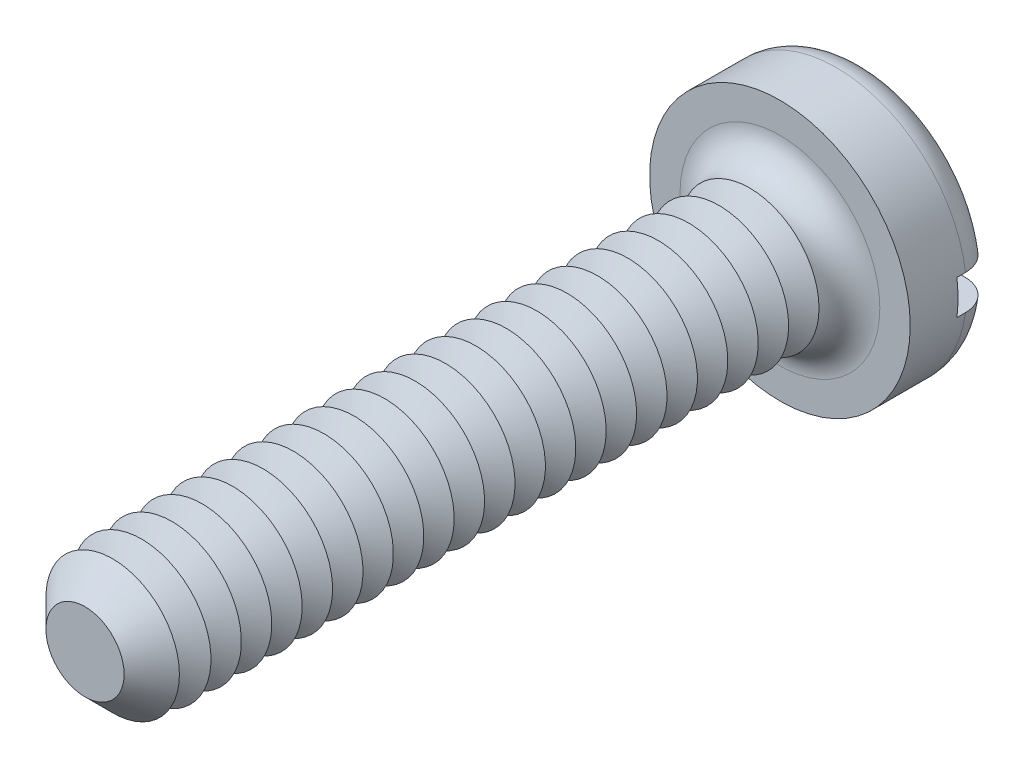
ISO-10303-21;
HEADER;
FILE_DESCRIPTION(('STEP AP214'),'2;1');
FILE_NAME('part.step','',(''),(''),'','','');
FILE_SCHEMA(('AUTOMOTIVE_DESIGN { 1 0 10303 214 1 1 1 1 }'));
ENDSEC;
DATA;
#1=APPLICATION_CONTEXT('core data for automotive mechanical design processes');
#2=APPLICATION_PROTOCOL_DEFINITION('international standard','automotive_design',2000,#1);
#3=PRODUCT_CONTEXT('',#1,'mechanical');
#4=PRODUCT('Part','Part','',(#3));
#5=PRODUCT_RELATED_PRODUCT_CATEGORY('part','',(#4));
#6=PRODUCT_DEFINITION_FORMATION('','',#4);
#7=PRODUCT_DEFINITION_CONTEXT('part definition',#1,'design');
#8=PRODUCT_DEFINITION('design','',#6,#7);
#9=PRODUCT_DEFINITION_SHAPE('','',#8);
#10=(LENGTH_UNIT() NAMED_UNIT(*) SI_UNIT(.MILLI.,.METRE.));
#11=(NAMED_UNIT(*) PLANE_ANGLE_UNIT() SI_UNIT($,.RADIAN.));
#12=(NAMED_UNIT(*) SI_UNIT($,.STERADIAN.) SOLID_ANGLE_UNIT());
#13=UNCERTAINTY_MEASURE_WITH_UNIT(LENGTH_MEASURE(1.E-05),#10,'distance_accuracy_value','');
#14=(GEOMETRIC_REPRESENTATION_CONTEXT(3) GLOBAL_UNCERTAINTY_ASSIGNED_CONTEXT((#13)) GLOBAL_UNIT_ASSIGNED_CONTEXT((#10,
#11,#12)) REPRESENTATION_CONTEXT('',''));
#15=CARTESIAN_POINT('',(0.,0.,0.));
#16=DIRECTION('',(0.,0.,1.));
#17=DIRECTION('',(1.,0.,0.));
#18=AXIS2_PLACEMENT_3D('',#15,#16,#17);
#19=CARTESIAN_POINT('',(0.,0.,-1.));
#20=DIRECTION('',(0.,0.,1.));
#21=DIRECTION('',(1.,0.,0.));
#22=AXIS2_PLACEMENT_3D('',#19,#20,#21);
#23=PLANE('',#22);
#24=CARTESIAN_POINT('',(0.,0.,-1.));
#25=DIRECTION('',(0.,0.,1.));
#26=DIRECTION('',(1.,0.,0.));
#27=AXIS2_PLACEMENT_3D('',#24,#25,#26);
#28=CIRCLE('',#27,1.15);
#29=CARTESIAN_POINT('',(-1.13247516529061,0.2,-1.));
#30=VERTEX_POINT('',#29);
#31=CARTESIAN_POINT('',(1.13247516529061,0.2,-1.));
#32=VERTEX_POINT('',#31);
#33=EDGE_CURVE('E116',#30,#32,#28,.F.);
#34=ORIENTED_EDGE('',*,*,#33,.T.);
#35=DIRECTION('',(1.,0.,0.));
#36=VECTOR('',#35,1.);
#37=CARTESIAN_POINT('',(-1.5,0.2,-1.));
#38=LINE('',#37,#36);
#39=EDGE_CURVE('E111',#30,#32,#38,.T.);
#40=ORIENTED_EDGE('',*,*,#39,.F.);
#41=EDGE_LOOP('',(#34,#40));
#42=FACE_BOUND('',#41,.T.);
#43=ADVANCED_FACE('F39',(#42),#23,.F.);
#44=CARTESIAN_POINT('',(0.,0.,-0.65));
#45=DIRECTION('',(0.,0.,1.));
#46=DIRECTION('',(1.,0.,0.));
#47=AXIS2_PLACEMENT_3D('',#44,#45,#46);
#48=TOROIDAL_SURFACE('',#47,1.15,0.35);
#49=CARTESIAN_POINT('',(-1.38697162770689,0.2,-0.89359719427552));
#50=CARTESIAN_POINT('',(-1.37305556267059,0.2,-0.907805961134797));
#51=CARTESIAN_POINT('',(-1.35791811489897,0.2,-0.9208403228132));
#52=CARTESIAN_POINT('',(-1.32565069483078,0.2,-0.944183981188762));
#53=CARTESIAN_POINT('',(-1.3085180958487,0.2,-0.954489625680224));
#54=CARTESIAN_POINT('',(-1.27278567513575,0.2,-0.972077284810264));
#55=CARTESIAN_POINT('',(-1.25418732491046,0.2,-0.979362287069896));
#56=CARTESIAN_POINT('',(-1.21604452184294,0.2,-0.990735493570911));
#57=CARTESIAN_POINT('',(-1.19650030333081,0.2,-0.994824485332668));
#58=CARTESIAN_POINT('',(-1.15682398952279,0.2,-0.99973845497));
#59=CARTESIAN_POINT('',(-1.1366881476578,0.2,-1.00053316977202));
#60=CARTESIAN_POINT('',(-1.09656272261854,0.2,-0.998770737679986));
#61=CARTESIAN_POINT('',(-1.07657315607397,0.2,-0.996213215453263));
#62=CARTESIAN_POINT('',(-1.03707277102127,0.2,-0.987780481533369));
#63=CARTESIAN_POINT('',(-1.01756977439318,0.2,-0.981868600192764));
#64=CARTESIAN_POINT('',(-0.979825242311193,0.2,-0.966867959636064));
#65=CARTESIAN_POINT('',(-0.961583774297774,0.2,-0.957779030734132));
#66=CARTESIAN_POINT('',(-0.926815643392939,0.2,-0.936628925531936));
#67=CARTESIAN_POINT('',(-0.910295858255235,0.2,-0.924556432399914));
#68=CARTESIAN_POINT('',(-0.879544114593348,0.2,-0.897781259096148));
#69=CARTESIAN_POINT('',(-0.8653120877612,0.2,-0.883078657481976));
#70=CARTESIAN_POINT('',(-0.83972745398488,0.2,-0.851619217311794));
#71=CARTESIAN_POINT('',(-0.8283448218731,0.2,-0.834886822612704));
#72=CARTESIAN_POINT('',(-0.80863848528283,0.2,-0.799707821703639));
#73=CARTESIAN_POINT('',(-0.80031425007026,0.2,-0.781261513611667));
#74=CARTESIAN_POINT('',(-0.787199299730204,0.2,-0.743695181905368));
#75=CARTESIAN_POINT('',(-0.782321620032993,0.2,-0.724605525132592));
#76=CARTESIAN_POINT('',(-0.775930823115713,0.2,-0.685871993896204));
#77=CARTESIAN_POINT('',(-0.774417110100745,0.2,-0.666228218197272));
#78=CARTESIAN_POINT('',(-0.774805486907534,0.2,-0.627456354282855));
#79=CARTESIAN_POINT('',(-0.776625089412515,0.2,-0.608327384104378));
#80=CARTESIAN_POINT('',(-0.783452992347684,0.2,-0.570648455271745));
#81=CARTESIAN_POINT('',(-0.788461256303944,0.2,-0.552098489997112));
#82=CARTESIAN_POINT('',(-0.801489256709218,0.2,-0.516098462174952));
#83=CARTESIAN_POINT('',(-0.809507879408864,0.2,-0.49864799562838));
#84=CARTESIAN_POINT('',(-0.828295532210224,0.2,-0.465297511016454));
#85=CARTESIAN_POINT('',(-0.839064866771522,0.2,-0.449397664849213));
#86=CARTESIAN_POINT('',(-0.863311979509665,0.2,-0.419196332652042));
#87=CARTESIAN_POINT('',(-0.876847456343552,0.2,-0.404941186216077));
#88=CARTESIAN_POINT('',(-0.906064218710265,0.2,-0.378832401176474));
#89=CARTESIAN_POINT('',(-0.921745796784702,0.2,-0.366979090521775));
#90=CARTESIAN_POINT('',(-0.955261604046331,0.2,-0.345690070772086));
#91=CARTESIAN_POINT('',(-0.973141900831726,0.2,-0.336326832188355));
#92=CARTESIAN_POINT('',(-1.01020647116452,0.2,-0.320690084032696));
#93=CARTESIAN_POINT('',(-1.02939085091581,0.2,-0.314416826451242));
#94=CARTESIAN_POINT('',(-1.06878849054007,0.2,-0.305073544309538));
#95=CARTESIAN_POINT('',(-1.0890118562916,0.2,-0.302046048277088));
#96=CARTESIAN_POINT('',(-1.12968032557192,0.2,-0.299436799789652));
#97=CARTESIAN_POINT('',(-1.15012542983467,0.2,-0.299855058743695));
#98=CARTESIAN_POINT('',(-1.1906059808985,0.2,-0.304138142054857));
#99=CARTESIAN_POINT('',(-1.21064224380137,0.2,-0.307995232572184));
#100=CARTESIAN_POINT('',(-1.24976957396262,0.2,-0.319055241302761));
#101=CARTESIAN_POINT('',(-1.26886068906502,0.2,-0.326257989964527));
#102=CARTESIAN_POINT('',(-1.30533597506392,0.2,-0.343725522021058));
#103=CARTESIAN_POINT('',(-1.32273620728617,0.2,-0.353956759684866));
#104=CARTESIAN_POINT('',(-1.35554323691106,0.2,-0.377229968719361));
#105=CARTESIAN_POINT('',(-1.37095016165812,0.2,-0.390271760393));
#106=CARTESIAN_POINT('',(-1.39913145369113,0.2,-0.418621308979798));
#107=CARTESIAN_POINT('',(-1.41193602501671,0.2,-0.43389904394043));
#108=CARTESIAN_POINT('',(-1.43476712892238,0.2,-0.46640589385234));
#109=CARTESIAN_POINT('',(-1.44479381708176,0.2,-0.483634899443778));
#110=CARTESIAN_POINT('',(-1.4616814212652,0.2,-0.519367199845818));
#111=CARTESIAN_POINT('',(-1.46857323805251,0.2,-0.537855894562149));
#112=CARTESIAN_POINT('',(-1.4791331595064,0.2,-0.575731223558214));
#113=CARTESIAN_POINT('',(-1.48280152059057,0.2,-0.595117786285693));
#114=CARTESIAN_POINT('',(-1.4867930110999,0.2,-0.634109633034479));
#115=CARTESIAN_POINT('',(-1.48713684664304,0.2,-0.653712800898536));
#116=CARTESIAN_POINT('',(-1.48452244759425,0.2,-0.692702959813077));
#117=CARTESIAN_POINT('',(-1.48156342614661,0.2,-0.712089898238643));
#118=CARTESIAN_POINT('',(-1.47243636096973,0.2,-0.75006822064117));
#119=CARTESIAN_POINT('',(-1.46627182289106,0.2,-0.768660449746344));
#120=CARTESIAN_POINT('',(-1.45092056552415,0.2,-0.804533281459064));
#121=CARTESIAN_POINT('',(-1.44173755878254,0.2,-0.821815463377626));
#122=CARTESIAN_POINT('',(-1.42477940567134,0.2,-0.848152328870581));
#123=CARTESIAN_POINT('',(-1.41786672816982,0.2,-0.857773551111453));
#124=CARTESIAN_POINT('',(-1.40310412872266,0.2,-0.876267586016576));
#125=CARTESIAN_POINT('',(-1.39525421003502,0.2,-0.885140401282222));
#126=CARTESIAN_POINT('',(-1.38697162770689,0.2,-0.89359719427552));
#127=B_SPLINE_CURVE_WITH_KNOTS('',3,(#49,#50,#51,#52,#53,#54,#55,#56,#57,#58,#59,#60,#61,#62,
#63,#64,#65,#66,#67,#68,#69,#70,#71,#72,#73,#74,#75,#76,#77,#78,#79,#80,#81,#82,#83,#84,#85,#86,
#87,#88,#89,#90,#91,#92,#93,#94,#95,#96,#97,#98,#99,#100,#101,#102,#103,#104,#105,#106,#107,
#108,#109,#110,#111,#112,#113,#114,#115,#116,#117,#118,#119,#120,#121,#122,#123,#124,#125,#126),
.UNSPECIFIED.,.T.,.F.,(4,2,2,2,2,2,2,2,2,2,2,2,2,2,2,2,2,2,2,2,2,2,2,2,2,2,2,2,2,2,2,2,2,2,2,2,
2,2,4),(0.,0.0596211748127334,0.119321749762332,0.178963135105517,0.238589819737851,
0.298763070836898,0.358943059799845,0.419793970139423,0.48064813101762,0.541736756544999,
0.602823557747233,0.663236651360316,0.72363925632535,0.782457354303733,0.841265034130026,
0.898637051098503,0.956008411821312,1.01335856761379,1.07071507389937,1.12941939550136,
1.18813172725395,1.24840147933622,1.30867614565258,1.36973127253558,1.43078660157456,
1.49170496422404,1.55262023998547,1.61288453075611,1.67314496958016,1.73266007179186,
1.792171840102,1.85108355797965,1.90999058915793,1.96853049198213,2.02708434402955,
2.08557429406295,2.14399257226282,2.17947810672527,2.21496351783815),.UNSPECIFIED.);
#128=CARTESIAN_POINT('',(-1.48660687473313,0.2,-0.649999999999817));
#129=VERTEX_POINT('',#128);
#130=EDGE_CURVE('E353',#129,#30,#127,.T.);
#131=ORIENTED_EDGE('',*,*,#130,.F.);
#132=CARTESIAN_POINT('',(0.,0.,-0.65));
#133=DIRECTION('',(0.,0.,1.));
#134=DIRECTION('',(1.,0.,0.));
#135=AXIS2_PLACEMENT_3D('',#132,#133,#134);
#136=CIRCLE('',#135,1.5);
#137=CARTESIAN_POINT('',(1.48660687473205,0.2,-0.649999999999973));
#138=VERTEX_POINT('',#137);
#139=EDGE_CURVE('E125',#138,#129,#136,.T.);
#140=ORIENTED_EDGE('',*,*,#139,.F.);
#141=CARTESIAN_POINT('',(0.780520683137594,0.2,-0.713112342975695));
#142=CARTESIAN_POINT('',(0.784146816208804,0.2,-0.73226748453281));
#143=CARTESIAN_POINT('',(0.789425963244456,0.2,-0.751125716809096));
#144=CARTESIAN_POINT('',(0.803106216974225,0.2,-0.78769198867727));
#145=CARTESIAN_POINT('',(0.811511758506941,0.2,-0.805398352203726));
#146=CARTESIAN_POINT('',(0.831144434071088,0.2,-0.839131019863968));
#147=CARTESIAN_POINT('',(0.842366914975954,0.2,-0.855160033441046));
#148=CARTESIAN_POINT('',(0.867288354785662,0.2,-0.88515062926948));
#149=CARTESIAN_POINT('',(0.880986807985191,0.2,-0.899112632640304));
#150=CARTESIAN_POINT('',(0.910770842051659,0.2,-0.924888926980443));
#151=CARTESIAN_POINT('',(0.926899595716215,0.2,-0.936653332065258));
#152=CARTESIAN_POINT('',(0.960871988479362,0.2,-0.957372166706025));
#153=CARTESIAN_POINT('',(0.978715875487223,0.2,-0.966326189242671));
#154=CARTESIAN_POINT('',(1.01600338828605,0.2,-0.981340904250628));
#155=CARTESIAN_POINT('',(1.03547204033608,0.2,-0.987339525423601));
#156=CARTESIAN_POINT('',(1.07513874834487,0.2,-0.995998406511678));
#157=CARTESIAN_POINT('',(1.09533683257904,0.2,-0.998658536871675));
#158=CARTESIAN_POINT('',(1.1359751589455,0.2,-1.0005575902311));
#159=CARTESIAN_POINT('',(1.1564160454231,0.2,-0.99978283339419));
#160=CARTESIAN_POINT('',(1.19687229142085,0.2,-0.994784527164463));
#161=CARTESIAN_POINT('',(1.21688766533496,0.2,-0.990561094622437));
#162=CARTESIAN_POINT('',(1.25575385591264,0.2,-0.978813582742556));
#163=CARTESIAN_POINT('',(1.27461259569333,0.2,-0.971315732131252));
#164=CARTESIAN_POINT('',(1.31078063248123,0.2,-0.953221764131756));
#165=CARTESIAN_POINT('',(1.32809002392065,0.2,-0.942625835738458));
#166=CARTESIAN_POINT('',(1.36044102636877,0.2,-0.918776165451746));
#167=CARTESIAN_POINT('',(1.37550786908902,0.2,-0.905556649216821));
#168=CARTESIAN_POINT('',(1.40317627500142,0.2,-0.876749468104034));
#169=CARTESIAN_POINT('',(1.41577799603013,0.2,-0.861161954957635));
#170=CARTESIAN_POINT('',(1.43800830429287,0.2,-0.828254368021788));
#171=CARTESIAN_POINT('',(1.44766923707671,0.2,-0.810956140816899));
#172=CARTESIAN_POINT('',(1.46392269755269,0.2,-0.774973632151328));
#173=CARTESIAN_POINT('',(1.4705153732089,0.2,-0.756289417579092));
#174=CARTESIAN_POINT('',(1.48039453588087,0.2,-0.718226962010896));
#175=CARTESIAN_POINT('',(1.48370713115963,0.2,-0.69885549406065));
#176=CARTESIAN_POINT('',(1.48701993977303,0.2,-0.659831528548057));
#177=CARTESIAN_POINT('',(1.4870202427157,0.2,-0.640179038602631));
#178=CARTESIAN_POINT('',(1.48371470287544,0.2,-0.6012267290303));
#179=CARTESIAN_POINT('',(1.48042091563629,0.2,-0.581925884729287));
#180=CARTESIAN_POINT('',(1.47064268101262,0.2,-0.544150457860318));
#181=CARTESIAN_POINT('',(1.46415824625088,0.2,-0.525675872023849));
#182=CARTESIAN_POINT('',(1.4481813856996,0.2,-0.490055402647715));
#183=CARTESIAN_POINT('',(1.43868601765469,0.2,-0.472910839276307));
#184=CARTESIAN_POINT('',(1.41696658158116,0.2,-0.440447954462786));
#185=CARTESIAN_POINT('',(1.40474246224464,0.2,-0.425129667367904));
#186=CARTESIAN_POINT('',(1.37784446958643,0.2,-0.39666049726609));
#187=CARTESIAN_POINT('',(1.36315749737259,0.2,-0.383521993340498));
#188=CARTESIAN_POINT('',(1.33180407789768,0.2,-0.359869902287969));
#189=CARTESIAN_POINT('',(1.31513754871,0.2,-0.349356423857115));
#190=CARTESIAN_POINT('',(1.28013085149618,0.2,-0.331143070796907));
#191=CARTESIAN_POINT('',(1.26177629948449,0.2,-0.323470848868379));
#192=CARTESIAN_POINT('',(1.224049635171,0.2,-0.311275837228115));
#193=CARTESIAN_POINT('',(1.20467746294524,0.2,-0.306753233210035));
#194=CARTESIAN_POINT('',(1.1652160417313,0.2,-0.300927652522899));
#195=CARTESIAN_POINT('',(1.14512096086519,0.2,-0.299664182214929));
#196=CARTESIAN_POINT('',(1.10499953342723,0.2,-0.300488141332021));
#197=CARTESIAN_POINT('',(1.08497319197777,0.2,-0.302575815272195));
#198=CARTESIAN_POINT('',(1.04531606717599,0.2,-0.310075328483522));
#199=CARTESIAN_POINT('',(1.0256923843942,0.2,-0.315524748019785));
#200=CARTESIAN_POINT('',(0.987629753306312,0.2,-0.329624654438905));
#201=CARTESIAN_POINT('',(0.96919087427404,0.2,-0.338275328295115));
#202=CARTESIAN_POINT('',(0.933939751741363,0.2,-0.358590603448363));
#203=CARTESIAN_POINT('',(0.917135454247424,0.2,-0.370269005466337));
#204=CARTESIAN_POINT('',(0.88574931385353,0.2,-0.396306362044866));
#205=CARTESIAN_POINT('',(0.87116734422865,0.2,-0.410665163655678));
#206=CARTESIAN_POINT('',(0.844813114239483,0.2,-0.441518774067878));
#207=CARTESIAN_POINT('',(0.833014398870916,0.2,-0.457990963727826));
#208=CARTESIAN_POINT('',(0.812431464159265,0.2,-0.492729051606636));
#209=CARTESIAN_POINT('',(0.803647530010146,0.2,-0.510995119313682));
#210=CARTESIAN_POINT('',(0.789590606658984,0.2,-0.548308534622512));
#211=CARTESIAN_POINT('',(0.784235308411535,0.2,-0.5673249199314));
#212=CARTESIAN_POINT('',(0.7768953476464,0.2,-0.605979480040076));
#213=CARTESIAN_POINT('',(0.774905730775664,0.2,-0.625616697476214));
#214=CARTESIAN_POINT('',(0.774470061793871,0.2,-0.656633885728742));
#215=CARTESIAN_POINT('',(0.7748847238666,0.2,-0.668009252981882));
#216=CARTESIAN_POINT('',(0.776852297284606,0.2,-0.690660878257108));
#217=CARTESIAN_POINT('',(0.77840517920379,0.2,-0.701937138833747));
#218=CARTESIAN_POINT('',(0.780520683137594,0.2,-0.713112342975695));
#219=B_SPLINE_CURVE_WITH_KNOTS('',3,(#141,#142,#143,#144,#145,#146,#147,#148,#149,#150,#151,
#152,#153,#154,#155,#156,#157,#158,#159,#160,#161,#162,#163,#164,#165,#166,#167,#168,#169,#170,
#171,#172,#173,#174,#175,#176,#177,#178,#179,#180,#181,#182,#183,#184,#185,#186,#187,#188,#189,
#190,#191,#192,#193,#194,#195,#196,#197,#198,#199,#200,#201,#202,#203,#204,#205,#206,#207,#208,
#209,#210,#211,#212,#213,#214,#215,#216,#217,#218),.UNSPECIFIED.,.T.,.F.,(4,2,2,2,2,2,2,2,2,2,2,
2,2,2,2,2,2,2,2,2,2,2,2,2,2,2,2,2,2,2,2,2,2,2,2,2,2,2,4),(0.,0.0584431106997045,
0.11696944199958,0.175399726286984,0.233818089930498,0.293433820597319,0.353058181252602,
0.413886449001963,0.474717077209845,0.53579018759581,0.596861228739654,0.65745180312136,
0.718038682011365,0.777881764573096,0.837721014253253,0.896876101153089,0.95602833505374,
1.01470585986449,1.07338179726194,1.13184377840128,1.19030552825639,1.24882458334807,
1.30734473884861,1.36618662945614,1.42503095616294,1.48443380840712,1.54384016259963,
1.60396331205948,1.66409084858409,1.72490303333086,1.78571877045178,1.84681674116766,
1.90791122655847,1.96839922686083,2.02889294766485,2.08787382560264,2.14676780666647,
2.18086468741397,2.21496068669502),.UNSPECIFIED.);
#220=EDGE_CURVE('E355',#32,#138,#219,.T.);
#221=ORIENTED_EDGE('',*,*,#220,.F.);
#222=ORIENTED_EDGE('',*,*,#33,.F.);
#223=EDGE_LOOP('',(#131,#140,#221,#222));
#224=FACE_BOUND('',#223,.T.);
#225=ADVANCED_FACE('F337',(#224),#48,.T.);
#226=CARTESIAN_POINT('',(0.,0.,-1.));
#227=DIRECTION('',(0.,0.,1.));
#228=DIRECTION('',(1.,0.,0.));
#229=AXIS2_PLACEMENT_3D('',#226,#227,#228);
#230=CYLINDRICAL_SURFACE('',#229,1.5);
#231=DIRECTION('',(0.,0.,1.));
#232=VECTOR('',#231,1.);
#233=CARTESIAN_POINT('',(1.48660687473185,0.2,-1.));
#234=LINE('',#233,#232);
#235=CARTESIAN_POINT('',(1.48660687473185,0.2,-0.55));
#236=VERTEX_POINT('',#235);
#237=EDGE_CURVE('E370',#138,#236,#234,.T.);
#238=ORIENTED_EDGE('',*,*,#237,.F.);
#239=ORIENTED_EDGE('',*,*,#139,.T.);
#240=DIRECTION('',(0.,0.,1.));
#241=VECTOR('',#240,1.);
#242=CARTESIAN_POINT('',(-1.48660687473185,0.2,-1.));
#243=LINE('',#242,#241);
#244=CARTESIAN_POINT('',(-1.48660687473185,0.2,-0.55));
#245=VERTEX_POINT('',#244);
#246=EDGE_CURVE('E63',#245,#129,#243,.F.);
#247=ORIENTED_EDGE('',*,*,#246,.F.);
#248=CARTESIAN_POINT('',(0.,0.,-0.55));
#249=DIRECTION('',(0.,0.,-1.));
#250=DIRECTION('',(-1.,0.,0.));
#251=AXIS2_PLACEMENT_3D('',#248,#249,#250);
#252=CIRCLE('',#251,1.5);
#253=CARTESIAN_POINT('',(-1.48660687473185,-0.2,-0.55));
#254=VERTEX_POINT('',#253);
#255=EDGE_CURVE('E43',#245,#254,#252,.F.);
#256=ORIENTED_EDGE('',*,*,#255,.T.);
#257=DIRECTION('',(0.,0.,1.));
#258=VECTOR('',#257,1.);
#259=CARTESIAN_POINT('',(-1.48660687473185,-0.2,-1.));
#260=LINE('',#259,#258);
#261=CARTESIAN_POINT('',(-1.48660687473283,-0.2,-0.650000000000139));
#262=VERTEX_POINT('',#261);
#263=EDGE_CURVE('E367',#262,#254,#260,.T.);
#264=ORIENTED_EDGE('',*,*,#263,.F.);
#265=CARTESIAN_POINT('',(1.48660687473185,-0.2,-0.65));
#266=VERTEX_POINT('',#265);
#267=EDGE_CURVE('E127',#262,#266,#136,.T.);
#268=ORIENTED_EDGE('',*,*,#267,.T.);
#269=DIRECTION('',(0.,0.,1.));
#270=VECTOR('',#269,1.);
#271=CARTESIAN_POINT('',(1.48660687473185,-0.2,-1.));
#272=LINE('',#271,#270);
#273=CARTESIAN_POINT('',(1.48660687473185,-0.2,-0.55));
#274=VERTEX_POINT('',#273);
#275=EDGE_CURVE('E55',#274,#266,#272,.F.);
#276=ORIENTED_EDGE('',*,*,#275,.F.);
#277=EDGE_CURVE('E11',#274,#236,#252,.F.);
#278=ORIENTED_EDGE('',*,*,#277,.T.);
#279=EDGE_LOOP('',(#238,#239,#247,#256,#264,#268,#276,#278));
#280=FACE_BOUND('',#279,.T.);
#281=CARTESIAN_POINT('',(0.,0.,0.));
#282=DIRECTION('',(0.,0.,1.));
#283=DIRECTION('',(1.,0.,0.));
#284=AXIS2_PLACEMENT_3D('',#281,#282,#283);
#285=CIRCLE('',#284,1.5);
#286=CARTESIAN_POINT('',(1.5,0.,0.));
#287=VERTEX_POINT('',#286);
#288=EDGE_CURVE('E372',#287,#287,#285,.T.);
#289=ORIENTED_EDGE('',*,*,#288,.F.);
#290=EDGE_LOOP('',(#289));
#291=FACE_BOUND('',#290,.T.);
#292=ADVANCED_FACE('F333',(#280,#291),#230,.T.);
#293=CARTESIAN_POINT('',(1.13247516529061,-0.2,-1.));
#294=VERTEX_POINT('',#293);
#295=CARTESIAN_POINT('',(-1.13247516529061,-0.2,-1.));
#296=VERTEX_POINT('',#295);
#297=EDGE_CURVE('E109',#294,#296,#28,.F.);
#298=ORIENTED_EDGE('',*,*,#297,.T.);
#299=DIRECTION('',(-1.,0.,0.));
#300=VECTOR('',#299,1.);
#301=CARTESIAN_POINT('',(-1.5,-0.2,-1.));
#302=LINE('',#301,#300);
#303=EDGE_CURVE('E96',#294,#296,#302,.T.);
#304=ORIENTED_EDGE('',*,*,#303,.F.);
#305=EDGE_LOOP('',(#298,#304));
#306=FACE_BOUND('',#305,.T.);
#307=ADVANCED_FACE('F108',(#306),#23,.F.);
#308=CARTESIAN_POINT('',(0.,0.,0.));
#309=DIRECTION('',(0.,0.,1.));
#310=DIRECTION('',(1.,0.,0.));
#311=AXIS2_PLACEMENT_3D('',#308,#309,#310);
#312=PLANE('',#311);
#313=CARTESIAN_POINT('',(0.,0.,0.));
#314=DIRECTION('',(0.,0.,1.));
#315=DIRECTION('',(1.,0.,0.));
#316=AXIS2_PLACEMENT_3D('',#313,#314,#315);
#317=CIRCLE('',#316,1.15);
#318=CARTESIAN_POINT('',(1.15,0.,0.));
#319=VERTEX_POINT('',#318);
#320=EDGE_CURVE('E115',#319,#319,#317,.F.);
#321=ORIENTED_EDGE('',*,*,#320,.T.);
#322=EDGE_LOOP('',(#321));
#323=FACE_BOUND('',#322,.T.);
#324=ORIENTED_EDGE('',*,*,#288,.T.);
#325=EDGE_LOOP('',(#324));
#326=FACE_BOUND('',#325,.T.);
#327=ADVANCED_FACE('F332',(#323,#326),#312,.T.);
#328=CARTESIAN_POINT('',(-1.38697162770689,-0.2,-0.89359719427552));
#329=CARTESIAN_POINT('',(-1.40068341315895,-0.2,-0.87959447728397));
#330=CARTESIAN_POINT('',(-1.41322919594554,-0.2,-0.864431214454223));
#331=CARTESIAN_POINT('',(-1.43561095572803,-0.2,-0.83220389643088));
#332=CARTESIAN_POINT('',(-1.44544396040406,-0.2,-0.815137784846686));
#333=CARTESIAN_POINT('',(-1.46209732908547,-0.2,-0.779595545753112));
#334=CARTESIAN_POINT('',(-1.46891825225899,-0.2,-0.761119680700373));
#335=CARTESIAN_POINT('',(-1.479344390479,-0.2,-0.723286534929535));
#336=CARTESIAN_POINT('',(-1.48295036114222,-0.2,-0.703929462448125));
#337=CARTESIAN_POINT('',(-1.48683413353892,-0.2,-0.6649653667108));
#338=CARTESIAN_POINT('',(-1.48712565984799,-0.2,-0.645359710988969));
#339=CARTESIAN_POINT('',(-1.48440736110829,-0.2,-0.606378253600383));
#340=CARTESIAN_POINT('',(-1.48139747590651,-0.2,-0.587002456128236));
#341=CARTESIAN_POINT('',(-1.47217267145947,-0.2,-0.549061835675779));
#342=CARTESIAN_POINT('',(-1.46596274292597,-0.2,-0.530495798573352));
#343=CARTESIAN_POINT('',(-1.45052327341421,-0.2,-0.494665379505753));
#344=CARTESIAN_POINT('',(-1.44129371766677,-0.2,-0.477401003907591));
#345=CARTESIAN_POINT('',(-1.42005139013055,-0.2,-0.444603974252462));
#346=CARTESIAN_POINT('',(-1.40803014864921,-0.2,-0.429076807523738));
#347=CARTESIAN_POINT('',(-1.38156905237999,-0.2,-0.400242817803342));
#348=CARTESIAN_POINT('',(-1.36712913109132,-0.2,-0.386936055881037));
#349=CARTESIAN_POINT('',(-1.33612890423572,-0.2,-0.362811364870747));
#350=CARTESIAN_POINT('',(-1.31955365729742,-0.2,-0.352012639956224));
#351=CARTESIAN_POINT('',(-1.28484098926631,-0.2,-0.333316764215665));
#352=CARTESIAN_POINT('',(-1.26670348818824,-0.2,-0.325419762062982));
#353=CARTESIAN_POINT('',(-1.22917040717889,-0.2,-0.31265726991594));
#354=CARTESIAN_POINT('',(-1.20976324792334,-0.2,-0.3078258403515));
#355=CARTESIAN_POINT('',(-1.17041685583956,-0.2,-0.30144641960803));
#356=CARTESIAN_POINT('',(-1.15047758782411,-0.2,-0.299898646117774));
#357=CARTESIAN_POINT('',(-1.11037109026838,-0.2,-0.300112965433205));
#358=CARTESIAN_POINT('',(-1.09020407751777,-0.2,-0.301916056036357));
#359=CARTESIAN_POINT('',(-1.05044996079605,-0.2,-0.308849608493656));
#360=CARTESIAN_POINT('',(-1.03086289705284,-0.2,-0.313980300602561));
#361=CARTESIAN_POINT('',(-0.992636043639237,-0.2,-0.327485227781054));
#362=CARTESIAN_POINT('',(-0.974006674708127,-0.2,-0.335888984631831));
#363=CARTESIAN_POINT('',(-0.938423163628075,-0.2,-0.355707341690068));
#364=CARTESIAN_POINT('',(-0.921469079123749,-0.2,-0.367122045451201));
#365=CARTESIAN_POINT('',(-0.889752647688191,-0.2,-0.392642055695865));
#366=CARTESIAN_POINT('',(-0.874987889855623,-0.2,-0.406744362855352));
#367=CARTESIAN_POINT('',(-0.848085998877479,-0.2,-0.437266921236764));
#368=CARTESIAN_POINT('',(-0.835948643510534,-0.2,-0.453686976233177));
#369=CARTESIAN_POINT('',(-0.814894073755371,-0.2,-0.488078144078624));
#370=CARTESIAN_POINT('',(-0.805923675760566,-0.2,-0.506016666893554));
#371=CARTESIAN_POINT('',(-0.791223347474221,-0.2,-0.543175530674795));
#372=CARTESIAN_POINT('',(-0.78549275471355,-0.2,-0.562395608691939));
#373=CARTESIAN_POINT('',(-0.777599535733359,-0.2,-0.600984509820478));
#374=CARTESIAN_POINT('',(-0.775340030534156,-0.2,-0.62033354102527));
#375=CARTESIAN_POINT('',(-0.774164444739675,-0.2,-0.659131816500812));
#376=CARTESIAN_POINT('',(-0.775247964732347,-0.2,-0.678581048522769));
#377=CARTESIAN_POINT('',(-0.78067015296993,-0.2,-0.716679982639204));
#378=CARTESIAN_POINT('',(-0.784953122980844,-0.2,-0.735337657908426));
#379=CARTESIAN_POINT('',(-0.796558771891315,-0.2,-0.771681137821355));
#380=CARTESIAN_POINT('',(-0.803881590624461,-0.2,-0.789366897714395));
#381=CARTESIAN_POINT('',(-0.821417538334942,-0.2,-0.823475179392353));
#382=CARTESIAN_POINT('',(-0.831660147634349,-0.2,-0.839882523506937));
#383=CARTESIAN_POINT('',(-0.854684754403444,-0.2,-0.870805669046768));
#384=CARTESIAN_POINT('',(-0.867467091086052,-0.2,-0.885321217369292));
#385=CARTESIAN_POINT('',(-0.895584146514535,-0.2,-0.912470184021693));
#386=CARTESIAN_POINT('',(-0.910979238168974,-0.2,-0.925041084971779));
#387=CARTESIAN_POINT('',(-0.943622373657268,-0.2,-0.947488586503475));
#388=CARTESIAN_POINT('',(-0.960870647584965,-0.2,-0.957364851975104));
#389=CARTESIAN_POINT('',(-0.997151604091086,-0.2,-0.974359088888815));
#390=CARTESIAN_POINT('',(-1.01621564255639,-0.2,-0.98141019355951));
#391=CARTESIAN_POINT('',(-1.05525219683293,-0.2,-0.992235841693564));
#392=CARTESIAN_POINT('',(-1.07522472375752,-0.2,-0.996010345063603));
#393=CARTESIAN_POINT('',(-1.11565152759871,-0.2,-1.00018247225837));
#394=CARTESIAN_POINT('',(-1.1361080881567,-0.2,-1.00055804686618));
#395=CARTESIAN_POINT('',(-1.17679659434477,-0.2,-0.997846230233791));
#396=CARTESIAN_POINT('',(-1.19702848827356,-0.2,-0.994758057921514));
#397=CARTESIAN_POINT('',(-1.23655375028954,-0.2,-0.985216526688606));
#398=CARTESIAN_POINT('',(-1.25585198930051,-0.2,-0.978783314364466));
#399=CARTESIAN_POINT('',(-1.29305658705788,-0.2,-0.962732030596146));
#400=CARTESIAN_POINT('',(-1.31096467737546,-0.2,-0.953118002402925));
#401=CARTESIAN_POINT('',(-1.33859353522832,-0.2,-0.935076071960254));
#402=CARTESIAN_POINT('',(-1.34889525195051,-0.2,-0.927521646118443));
#403=CARTESIAN_POINT('',(-1.36861998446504,-0.2,-0.911341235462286));
#404=CARTESIAN_POINT('',(-1.37804300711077,-0.2,-0.90271525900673));
#405=CARTESIAN_POINT('',(-1.38697162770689,-0.2,-0.89359719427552));
#406=B_SPLINE_CURVE_WITH_KNOTS('',3,(#328,#329,#330,#331,#332,#333,#334,#335,#336,#337,#338,
#339,#340,#341,#342,#343,#344,#345,#346,#347,#348,#349,#350,#351,#352,#353,#354,#355,#356,#357,
#358,#359,#360,#361,#362,#363,#364,#365,#366,#367,#368,#369,#370,#371,#372,#373,#374,#375,#376,
#377,#378,#379,#380,#381,#382,#383,#384,#385,#386,#387,#388,#389,#390,#391,#392,#393,#394,#395,
#396,#397,#398,#399,#400,#401,#402,#403,#404,#405),.UNSPECIFIED.,.T.,.F.,(4,2,2,2,2,2,2,2,2,2,2,
2,2,2,2,2,2,2,2,2,2,2,2,2,2,2,2,2,2,2,2,2,2,2,2,2,2,2,4),(0.,0.0587484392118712,
0.117560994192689,0.17636262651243,0.235150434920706,0.293694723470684,0.352240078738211,
0.410694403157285,0.46914901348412,0.527783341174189,0.586419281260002,0.645490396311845,
0.704564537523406,0.76428403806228,0.824007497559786,0.884466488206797,0.944929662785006,
1.00595131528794,1.06697506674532,1.12793111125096,1.18888199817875,1.2487542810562,
1.30861431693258,1.36677117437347,1.4249210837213,1.48208160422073,1.53924475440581,
1.59700685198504,1.65477666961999,1.71413044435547,1.77349159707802,1.83418476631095,
1.89487867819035,1.95596603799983,2.01706717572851,2.07780450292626,2.13846491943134,
2.17672008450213,2.21497495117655),.UNSPECIFIED.);
#407=EDGE_CURVE('E103',#296,#262,#406,.T.);
#408=ORIENTED_EDGE('',*,*,#407,.F.);
#409=ORIENTED_EDGE('',*,*,#297,.F.);
#410=CARTESIAN_POINT('',(0.780520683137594,-0.2,-0.713112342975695));
#411=CARTESIAN_POINT('',(0.776967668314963,-0.2,-0.694332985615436));
#412=CARTESIAN_POINT('',(0.774997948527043,-0.2,-0.675240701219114));
#413=CARTESIAN_POINT('',(0.774305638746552,-0.2,-0.636983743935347));
#414=CARTESIAN_POINT('',(0.775586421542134,-0.2,-0.617819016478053));
#415=CARTESIAN_POINT('',(0.781350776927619,-0.2,-0.579992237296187));
#416=CARTESIAN_POINT('',(0.78583187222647,-0.2,-0.56132980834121));
#417=CARTESIAN_POINT('',(0.797836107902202,-0.2,-0.525016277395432));
#418=CARTESIAN_POINT('',(0.805358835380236,-0.2,-0.507365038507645));
#419=CARTESIAN_POINT('',(0.823276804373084,-0.2,-0.47338978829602));
#420=CARTESIAN_POINT('',(0.833696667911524,-0.2,-0.457078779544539));
#421=CARTESIAN_POINT('',(0.857057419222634,-0.2,-0.426375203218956));
#422=CARTESIAN_POINT('',(0.869998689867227,-0.2,-0.411982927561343));
#423=CARTESIAN_POINT('',(0.898418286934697,-0.2,-0.38510575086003));
#424=CARTESIAN_POINT('',(0.913956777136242,-0.2,-0.372684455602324));
#425=CARTESIAN_POINT('',(0.946860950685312,-0.2,-0.350558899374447));
#426=CARTESIAN_POINT('',(0.964226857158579,-0.2,-0.340854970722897));
#427=CARTESIAN_POINT('',(1.00070854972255,-0.2,-0.324232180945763));
#428=CARTESIAN_POINT('',(1.01985442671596,-0.2,-0.317379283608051));
#429=CARTESIAN_POINT('',(1.0590214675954,-0.2,-0.306962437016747));
#430=CARTESIAN_POINT('',(1.07904267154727,-0.2,-0.303398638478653));
#431=CARTESIAN_POINT('',(1.11952320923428,-0.2,-0.299657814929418));
#432=CARTESIAN_POINT('',(1.13998446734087,-0.2,-0.299501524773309));
#433=CARTESIAN_POINT('',(1.1806395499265,-0.2,-0.302650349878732));
#434=CARTESIAN_POINT('',(1.20083338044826,-0.2,-0.305955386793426));
#435=CARTESIAN_POINT('',(1.24023260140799,-0.2,-0.315918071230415));
#436=CARTESIAN_POINT('',(1.25944372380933,-0.2,-0.322553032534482));
#437=CARTESIAN_POINT('',(1.29645854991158,-0.2,-0.338992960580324));
#438=CARTESIAN_POINT('',(1.31426233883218,-0.2,-0.348797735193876));
#439=CARTESIAN_POINT('',(1.34772734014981,-0.2,-0.371172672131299));
#440=CARTESIAN_POINT('',(1.36341179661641,-0.2,-0.383708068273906));
#441=CARTESIAN_POINT('',(1.39242189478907,-0.2,-0.41126267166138));
#442=CARTESIAN_POINT('',(1.40574768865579,-0.2,-0.426281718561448));
#443=CARTESIAN_POINT('',(1.42949833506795,-0.2,-0.458186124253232));
#444=CARTESIAN_POINT('',(1.43995542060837,-0.2,-0.475047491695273));
#445=CARTESIAN_POINT('',(1.45786189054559,-0.2,-0.510298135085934));
#446=CARTESIAN_POINT('',(1.46531142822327,-0.2,-0.528687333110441));
#447=CARTESIAN_POINT('',(1.47692889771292,-0.2,-0.566301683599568));
#448=CARTESIAN_POINT('',(1.48112438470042,-0.2,-0.585518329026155));
#449=CARTESIAN_POINT('',(1.48621428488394,-0.2,-0.624383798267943));
#450=CARTESIAN_POINT('',(1.48710879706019,-0.2,-0.644032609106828));
#451=CARTESIAN_POINT('',(1.48557356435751,-0.2,-0.683115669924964));
#452=CARTESIAN_POINT('',(1.48315796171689,-0.2,-0.702550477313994));
#453=CARTESIAN_POINT('',(1.47509909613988,-0.2,-0.740738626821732));
#454=CARTESIAN_POINT('',(1.46945585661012,-0.2,-0.759491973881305));
#455=CARTESIAN_POINT('',(1.45510530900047,-0.2,-0.79579446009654));
#456=CARTESIAN_POINT('',(1.44639690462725,-0.2,-0.813343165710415));
#457=CARTESIAN_POINT('',(1.42617120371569,-0.2,-0.846738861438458));
#458=CARTESIAN_POINT('',(1.41465386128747,-0.2,-0.862585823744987));
#459=CARTESIAN_POINT('',(1.3890808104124,-0.2,-0.892214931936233));
#460=CARTESIAN_POINT('',(1.37501291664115,-0.2,-0.90598655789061));
#461=CARTESIAN_POINT('',(1.34478283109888,-0.2,-0.930997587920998));
#462=CARTESIAN_POINT('',(1.32862056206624,-0.2,-0.942236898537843));
#463=CARTESIAN_POINT('',(1.29450693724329,-0.2,-0.96197581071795));
#464=CARTESIAN_POINT('',(1.27654077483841,-0.2,-0.970449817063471));
#465=CARTESIAN_POINT('',(1.23945233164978,-0.2,-0.984300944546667));
#466=CARTESIAN_POINT('',(1.2203299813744,-0.2,-0.989677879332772));
#467=CARTESIAN_POINT('',(1.18123021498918,-0.2,-0.997250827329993));
#468=CARTESIAN_POINT('',(1.16124534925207,-0.2,-0.999408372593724));
#469=CARTESIAN_POINT('',(1.12119456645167,-0.2,-1.00037966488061));
#470=CARTESIAN_POINT('',(1.10112864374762,-0.2,-0.999193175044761));
#471=CARTESIAN_POINT('',(1.06123417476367,-0.2,-0.993489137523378));
#472=CARTESIAN_POINT('',(1.0414112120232,-0.2,-0.988932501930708));
#473=CARTESIAN_POINT('',(1.00280276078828,-0.2,-0.976576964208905));
#474=CARTESIAN_POINT('',(0.984017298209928,-0.2,-0.968777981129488));
#475=CARTESIAN_POINT('',(0.947906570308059,-0.2,-0.95009587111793));
#476=CARTESIAN_POINT('',(0.930590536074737,-0.2,-0.939194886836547));
#477=CARTESIAN_POINT('',(0.89804559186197,-0.2,-0.914617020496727));
#478=CARTESIAN_POINT('',(0.882817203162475,-0.2,-0.900939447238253));
#479=CARTESIAN_POINT('',(0.855020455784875,-0.2,-0.871287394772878));
#480=CARTESIAN_POINT('',(0.84243415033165,-0.2,-0.855329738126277));
#481=CARTESIAN_POINT('',(0.820210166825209,-0.2,-0.821497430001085));
#482=CARTESIAN_POINT('',(0.810568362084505,-0.2,-0.803625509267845));
#483=CARTESIAN_POINT('',(0.797588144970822,-0.2,-0.773519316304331));
#484=CARTESIAN_POINT('',(0.793244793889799,-0.2,-0.761708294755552));
#485=CARTESIAN_POINT('',(0.785879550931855,-0.2,-0.737680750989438));
#486=CARTESIAN_POINT('',(0.782857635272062,-0.2,-0.725464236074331));
#487=CARTESIAN_POINT('',(0.780520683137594,-0.2,-0.713112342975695));
#488=B_SPLINE_CURVE_WITH_KNOTS('',3,(#410,#411,#412,#413,#414,#415,#416,#417,#418,#419,#420,
#421,#422,#423,#424,#425,#426,#427,#428,#429,#430,#431,#432,#433,#434,#435,#436,#437,#438,#439,
#440,#441,#442,#443,#444,#445,#446,#447,#448,#449,#450,#451,#452,#453,#454,#455,#456,#457,#458,
#459,#460,#461,#462,#463,#464,#465,#466,#467,#468,#469,#470,#471,#472,#473,#474,#475,#476,#477,
#478,#479,#480,#481,#482,#483,#484,#485,#486,#487),.UNSPECIFIED.,.T.,.F.,(4,2,2,2,2,2,2,2,2,2,2,
2,2,2,2,2,2,2,2,2,2,2,2,2,2,2,2,2,2,2,2,2,2,2,2,2,2,2,4),(0.,0.057291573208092,
0.114642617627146,0.171949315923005,0.229248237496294,0.287049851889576,0.344860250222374,
0.404266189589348,0.463679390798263,0.524399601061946,0.585122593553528,0.646214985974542,
0.707305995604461,0.767986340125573,0.828663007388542,0.888608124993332,0.948549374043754,
1.00778662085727,1.06702084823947,1.12574783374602,1.18447305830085,1.24294816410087,
1.30142284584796,1.35991846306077,1.41841503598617,1.47719881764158,1.5359847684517,
1.59530034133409,1.65461948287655,1.71464189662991,1.77466856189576,1.83540257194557,
1.89613809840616,1.9572305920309,2.01833831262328,2.0790164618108,2.13960917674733,
2.17729268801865,2.21497552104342),.UNSPECIFIED.);
#489=EDGE_CURVE('E92',#266,#294,#488,.T.);
#490=ORIENTED_EDGE('',*,*,#489,.F.);
#491=ORIENTED_EDGE('',*,*,#267,.F.);
#492=EDGE_LOOP('',(#408,#409,#490,#491));
#493=FACE_BOUND('',#492,.T.);
#494=ADVANCED_FACE('F113',(#493),#48,.T.);
#495=CARTESIAN_POINT('',(0.,0.,0.35));
#496=DIRECTION('',(0.,0.,1.));
#497=DIRECTION('',(1.,0.,0.));
#498=AXIS2_PLACEMENT_3D('',#495,#496,#497);
#499=TOROIDAL_SURFACE('',#498,1.15,0.35);
#500=ORIENTED_EDGE('',*,*,#320,.F.);
#501=EDGE_LOOP('',(#500));
#502=FACE_BOUND('',#501,.T.);
#503=CARTESIAN_POINT('',(0.,0.,0.35));
#504=DIRECTION('',(0.,0.,-1.));
#505=DIRECTION('',(-1.,0.,0.));
#506=AXIS2_PLACEMENT_3D('',#503,#504,#505);
#507=CIRCLE('',#506,0.8);
#508=CARTESIAN_POINT('',(-0.8,0.,0.35));
#509=VERTEX_POINT('',#508);
#510=EDGE_CURVE('E377',#509,#509,#507,.T.);
#511=ORIENTED_EDGE('',*,*,#510,.T.);
#512=EDGE_LOOP('',(#511));
#513=FACE_BOUND('',#512,.T.);
#514=ADVANCED_FACE('F325',(#502,#513),#499,.F.);
#515=CARTESIAN_POINT('',(0.,0.,0.524999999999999));
#516=DIRECTION('',(0.,0.,-1.));
#517=DIRECTION('',(-1.,0.,0.));
#518=AXIS2_PLACEMENT_3D('',#515,#516,#517);
#519=CONICAL_SURFACE('',#518,0.496891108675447,1.0471975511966);
#520=ORIENTED_EDGE('',*,*,#510,.F.);
#521=EDGE_LOOP('',(#520));
#522=FACE_BOUND('',#521,.T.);
#523=CARTESIAN_POINT('',(0.,0.,0.524999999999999));
#524=DIRECTION('',(0.,0.,-1.));
#525=DIRECTION('',(-1.,0.,0.));
#526=AXIS2_PLACEMENT_3D('',#523,#524,#525);
#527=CIRCLE('',#526,0.496891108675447);
#528=CARTESIAN_POINT('',(-0.496891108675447,0.,0.524999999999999));
#529=VERTEX_POINT('',#528);
#530=EDGE_CURVE('E384',#529,#529,#527,.T.);
#531=ORIENTED_EDGE('',*,*,#530,.T.);
#532=EDGE_LOOP('',(#531));
#533=FACE_BOUND('',#532,.T.);
#534=ADVANCED_FACE('F321',(#522,#533),#519,.T.);
#535=CARTESIAN_POINT('',(0.,0.,0.7));
#536=DIRECTION('',(0.,0.,1.));
#537=DIRECTION('',(1.,0.,0.));
#538=AXIS2_PLACEMENT_3D('',#535,#536,#537);
#539=CONICAL_SURFACE('',#538,0.8,1.0471975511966);
#540=ORIENTED_EDGE('',*,*,#530,.F.);
#541=EDGE_LOOP('',(#540));
#542=FACE_BOUND('',#541,.T.);
#543=CARTESIAN_POINT('',(0.,0.,0.7));
#544=DIRECTION('',(0.,0.,-1.));
#545=DIRECTION('',(-1.,0.,0.));
#546=AXIS2_PLACEMENT_3D('',#543,#544,#545);
#547=CIRCLE('',#546,0.8);
#548=CARTESIAN_POINT('',(-0.8,0.,0.7));
#549=VERTEX_POINT('',#548);
#550=EDGE_CURVE('E390',#549,#549,#547,.T.);
#551=ORIENTED_EDGE('',*,*,#550,.T.);
#552=EDGE_LOOP('',(#551));
#553=FACE_BOUND('',#552,.T.);
#554=ADVANCED_FACE('F317',(#542,#553),#539,.T.);
#555=CARTESIAN_POINT('',(0.,0.,0.874999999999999));
#556=DIRECTION('',(0.,0.,-1.));
#557=DIRECTION('',(-1.,0.,0.));
#558=AXIS2_PLACEMENT_3D('',#555,#556,#557);
#559=CONICAL_SURFACE('',#558,0.496891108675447,1.0471975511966);
#560=ORIENTED_EDGE('',*,*,#550,.F.);
#561=EDGE_LOOP('',(#560));
#562=FACE_BOUND('',#561,.T.);
#563=CARTESIAN_POINT('',(0.,0.,0.874999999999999));
#564=DIRECTION('',(0.,0.,-1.));
#565=DIRECTION('',(-1.,0.,0.));
#566=AXIS2_PLACEMENT_3D('',#563,#564,#565);
#567=CIRCLE('',#566,0.496891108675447);
#568=CARTESIAN_POINT('',(-0.496891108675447,0.,0.874999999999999));
#569=VERTEX_POINT('',#568);
#570=EDGE_CURVE('E394',#569,#569,#567,.T.);
#571=ORIENTED_EDGE('',*,*,#570,.T.);
#572=EDGE_LOOP('',(#571));
#573=FACE_BOUND('',#572,.T.);
#574=ADVANCED_FACE('F313',(#562,#573),#559,.T.);
#575=CARTESIAN_POINT('',(0.,0.,1.05));
#576=DIRECTION('',(0.,0.,1.));
#577=DIRECTION('',(1.,0.,0.));
#578=AXIS2_PLACEMENT_3D('',#575,#576,#577);
#579=CONICAL_SURFACE('',#578,0.8,1.0471975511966);
#580=ORIENTED_EDGE('',*,*,#570,.F.);
#581=EDGE_LOOP('',(#580));
#582=FACE_BOUND('',#581,.T.);
#583=CARTESIAN_POINT('',(0.,0.,1.05));
#584=DIRECTION('',(0.,0.,-1.));
#585=DIRECTION('',(-1.,0.,0.));
#586=AXIS2_PLACEMENT_3D('',#583,#584,#585);
#587=CIRCLE('',#586,0.8);
#588=CARTESIAN_POINT('',(-0.8,0.,1.05));
#589=VERTEX_POINT('',#588);
#590=EDGE_CURVE('E398',#589,#589,#587,.T.);
#591=ORIENTED_EDGE('',*,*,#590,.T.);
#592=EDGE_LOOP('',(#591));
#593=FACE_BOUND('',#592,.T.);
#594=ADVANCED_FACE('F309',(#582,#593),#579,.T.);
#595=CARTESIAN_POINT('',(0.,0.,1.225));
#596=DIRECTION('',(0.,0.,-1.));
#597=DIRECTION('',(-1.,0.,0.));
#598=AXIS2_PLACEMENT_3D('',#595,#596,#597);
#599=CONICAL_SURFACE('',#598,0.496891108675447,1.0471975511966);
#600=ORIENTED_EDGE('',*,*,#590,.F.);
#601=EDGE_LOOP('',(#600));
#602=FACE_BOUND('',#601,.T.);
#603=CARTESIAN_POINT('',(0.,0.,1.225));
#604=DIRECTION('',(0.,0.,-1.));
#605=DIRECTION('',(-1.,0.,0.));
#606=AXIS2_PLACEMENT_3D('',#603,#604,#605);
#607=CIRCLE('',#606,0.496891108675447);
#608=CARTESIAN_POINT('',(-0.496891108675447,0.,1.225));
#609=VERTEX_POINT('',#608);
#610=EDGE_CURVE('E402',#609,#609,#607,.T.);
#611=ORIENTED_EDGE('',*,*,#610,.T.);
#612=EDGE_LOOP('',(#611));
#613=FACE_BOUND('',#612,.T.);
#614=ADVANCED_FACE('F305',(#602,#613),#599,.T.);
#615=CARTESIAN_POINT('',(0.,0.,1.4));
#616=DIRECTION('',(0.,0.,1.));
#617=DIRECTION('',(1.,0.,0.));
#618=AXIS2_PLACEMENT_3D('',#615,#616,#617);
#619=CONICAL_SURFACE('',#618,0.8,1.0471975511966);
#620=ORIENTED_EDGE('',*,*,#610,.F.);
#621=EDGE_LOOP('',(#620));
#622=FACE_BOUND('',#621,.T.);
#623=CARTESIAN_POINT('',(0.,0.,1.4));
#624=DIRECTION('',(0.,0.,-1.));
#625=DIRECTION('',(-1.,0.,0.));
#626=AXIS2_PLACEMENT_3D('',#623,#624,#625);
#627=CIRCLE('',#626,0.8);
#628=CARTESIAN_POINT('',(-0.8,0.,1.4));
#629=VERTEX_POINT('',#628);
#630=EDGE_CURVE('E406',#629,#629,#627,.T.);
#631=ORIENTED_EDGE('',*,*,#630,.T.);
#632=EDGE_LOOP('',(#631));
#633=FACE_BOUND('',#632,.T.);
#634=ADVANCED_FACE('F301',(#622,#633),#619,.T.);
#635=CARTESIAN_POINT('',(0.,0.,1.575));
#636=DIRECTION('',(0.,0.,-1.));
#637=DIRECTION('',(-1.,0.,0.));
#638=AXIS2_PLACEMENT_3D('',#635,#636,#637);
#639=CONICAL_SURFACE('',#638,0.496891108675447,1.0471975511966);
#640=ORIENTED_EDGE('',*,*,#630,.F.);
#641=EDGE_LOOP('',(#640));
#642=FACE_BOUND('',#641,.T.);
#643=CARTESIAN_POINT('',(0.,0.,1.575));
#644=DIRECTION('',(0.,0.,-1.));
#645=DIRECTION('',(-1.,0.,0.));
#646=AXIS2_PLACEMENT_3D('',#643,#644,#645);
#647=CIRCLE('',#646,0.496891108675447);
#648=CARTESIAN_POINT('',(-0.496891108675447,0.,1.575));
#649=VERTEX_POINT('',#648);
#650=EDGE_CURVE('E410',#649,#649,#647,.T.);
#651=ORIENTED_EDGE('',*,*,#650,.T.);
#652=EDGE_LOOP('',(#651));
#653=FACE_BOUND('',#652,.T.);
#654=ADVANCED_FACE('F297',(#642,#653),#639,.T.);
#655=CARTESIAN_POINT('',(0.,0.,1.75));
#656=DIRECTION('',(0.,0.,1.));
#657=DIRECTION('',(1.,0.,0.));
#658=AXIS2_PLACEMENT_3D('',#655,#656,#657);
#659=CONICAL_SURFACE('',#658,0.8,1.0471975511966);
#660=ORIENTED_EDGE('',*,*,#650,.F.);
#661=EDGE_LOOP('',(#660));
#662=FACE_BOUND('',#661,.T.);
#663=CARTESIAN_POINT('',(0.,0.,1.75));
#664=DIRECTION('',(0.,0.,-1.));
#665=DIRECTION('',(-1.,0.,0.));
#666=AXIS2_PLACEMENT_3D('',#663,#664,#665);
#667=CIRCLE('',#666,0.8);
#668=CARTESIAN_POINT('',(-0.8,0.,1.75));
#669=VERTEX_POINT('',#668);
#670=EDGE_CURVE('E414',#669,#669,#667,.T.);
#671=ORIENTED_EDGE('',*,*,#670,.T.);
#672=EDGE_LOOP('',(#671));
#673=FACE_BOUND('',#672,.T.);
#674=ADVANCED_FACE('F293',(#662,#673),#659,.T.);
#675=CARTESIAN_POINT('',(0.,0.,1.925));
#676=DIRECTION('',(0.,0.,-1.));
#677=DIRECTION('',(-1.,0.,0.));
#678=AXIS2_PLACEMENT_3D('',#675,#676,#677);
#679=CONICAL_SURFACE('',#678,0.496891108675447,1.0471975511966);
#680=ORIENTED_EDGE('',*,*,#670,.F.);
#681=EDGE_LOOP('',(#680));
#682=FACE_BOUND('',#681,.T.);
#683=CARTESIAN_POINT('',(0.,0.,1.925));
#684=DIRECTION('',(0.,0.,-1.));
#685=DIRECTION('',(-1.,0.,0.));
#686=AXIS2_PLACEMENT_3D('',#683,#684,#685);
#687=CIRCLE('',#686,0.496891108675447);
#688=CARTESIAN_POINT('',(-0.496891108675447,0.,1.925));
#689=VERTEX_POINT('',#688);
#690=EDGE_CURVE('E418',#689,#689,#687,.T.);
#691=ORIENTED_EDGE('',*,*,#690,.T.);
#692=EDGE_LOOP('',(#691));
#693=FACE_BOUND('',#692,.T.);
#694=ADVANCED_FACE('F289',(#682,#693),#679,.T.);
#695=CARTESIAN_POINT('',(0.,0.,2.1));
#696=DIRECTION('',(0.,0.,1.));
#697=DIRECTION('',(1.,0.,0.));
#698=AXIS2_PLACEMENT_3D('',#695,#696,#697);
#699=CONICAL_SURFACE('',#698,0.8,1.0471975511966);
#700=ORIENTED_EDGE('',*,*,#690,.F.);
#701=EDGE_LOOP('',(#700));
#702=FACE_BOUND('',#701,.T.);
#703=CARTESIAN_POINT('',(0.,0.,2.1));
#704=DIRECTION('',(0.,0.,-1.));
#705=DIRECTION('',(-1.,0.,0.));
#706=AXIS2_PLACEMENT_3D('',#703,#704,#705);
#707=CIRCLE('',#706,0.8);
#708=CARTESIAN_POINT('',(-0.8,0.,2.1));
#709=VERTEX_POINT('',#708);
#710=EDGE_CURVE('E421',#709,#709,#707,.T.);
#711=ORIENTED_EDGE('',*,*,#710,.T.);
#712=EDGE_LOOP('',(#711));
#713=FACE_BOUND('',#712,.T.);
#714=ADVANCED_FACE('F285',(#702,#713),#699,.T.);
#715=CARTESIAN_POINT('',(0.,0.,2.275));
#716=DIRECTION('',(0.,0.,-1.));
#717=DIRECTION('',(-1.,0.,0.));
#718=AXIS2_PLACEMENT_3D('',#715,#716,#717);
#719=CONICAL_SURFACE('',#718,0.496891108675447,1.0471975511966);
#720=ORIENTED_EDGE('',*,*,#710,.F.);
#721=EDGE_LOOP('',(#720));
#722=FACE_BOUND('',#721,.T.);
#723=CARTESIAN_POINT('',(0.,0.,2.275));
#724=DIRECTION('',(0.,0.,-1.));
#725=DIRECTION('',(-1.,0.,0.));
#726=AXIS2_PLACEMENT_3D('',#723,#724,#725);
#727=CIRCLE('',#726,0.496891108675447);
#728=CARTESIAN_POINT('',(-0.496891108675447,0.,2.275));
#729=VERTEX_POINT('',#728);
#730=EDGE_CURVE('E425',#729,#729,#727,.T.);
#731=ORIENTED_EDGE('',*,*,#730,.T.);
#732=EDGE_LOOP('',(#731));
#733=FACE_BOUND('',#732,.T.);
#734=ADVANCED_FACE('F281',(#722,#733),#719,.T.);
#735=CARTESIAN_POINT('',(0.,0.,2.45));
#736=DIRECTION('',(0.,0.,1.));
#737=DIRECTION('',(1.,0.,0.));
#738=AXIS2_PLACEMENT_3D('',#735,#736,#737);
#739=CONICAL_SURFACE('',#738,0.8,1.0471975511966);
#740=ORIENTED_EDGE('',*,*,#730,.F.);
#741=EDGE_LOOP('',(#740));
#742=FACE_BOUND('',#741,.T.);
#743=CARTESIAN_POINT('',(0.,0.,2.45));
#744=DIRECTION('',(0.,0.,-1.));
#745=DIRECTION('',(-1.,0.,0.));
#746=AXIS2_PLACEMENT_3D('',#743,#744,#745);
#747=CIRCLE('',#746,0.8);
#748=CARTESIAN_POINT('',(-0.8,0.,2.45));
#749=VERTEX_POINT('',#748);
#750=EDGE_CURVE('E429',#749,#749,#747,.T.);
#751=ORIENTED_EDGE('',*,*,#750,.T.);
#752=EDGE_LOOP('',(#751));
#753=FACE_BOUND('',#752,.T.);
#754=ADVANCED_FACE('F277',(#742,#753),#739,.T.);
#755=CARTESIAN_POINT('',(0.,0.,2.625));
#756=DIRECTION('',(0.,0.,-1.));
#757=DIRECTION('',(-1.,0.,0.));
#758=AXIS2_PLACEMENT_3D('',#755,#756,#757);
#759=CONICAL_SURFACE('',#758,0.496891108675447,1.0471975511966);
#760=ORIENTED_EDGE('',*,*,#750,.F.);
#761=EDGE_LOOP('',(#760));
#762=FACE_BOUND('',#761,.T.);
#763=CARTESIAN_POINT('',(0.,0.,2.625));
#764=DIRECTION('',(0.,0.,-1.));
#765=DIRECTION('',(-1.,0.,0.));
#766=AXIS2_PLACEMENT_3D('',#763,#764,#765);
#767=CIRCLE('',#766,0.496891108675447);
#768=CARTESIAN_POINT('',(-0.496891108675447,0.,2.625));
#769=VERTEX_POINT('',#768);
#770=EDGE_CURVE('E433',#769,#769,#767,.T.);
#771=ORIENTED_EDGE('',*,*,#770,.T.);
#772=EDGE_LOOP('',(#771));
#773=FACE_BOUND('',#772,.T.);
#774=ADVANCED_FACE('F273',(#762,#773),#759,.T.);
#775=CARTESIAN_POINT('',(0.,0.,2.8));
#776=DIRECTION('',(0.,0.,1.));
#777=DIRECTION('',(1.,0.,0.));
#778=AXIS2_PLACEMENT_3D('',#775,#776,#777);
#779=CONICAL_SURFACE('',#778,0.8,1.0471975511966);
#780=ORIENTED_EDGE('',*,*,#770,.F.);
#781=EDGE_LOOP('',(#780));
#782=FACE_BOUND('',#781,.T.);
#783=CARTESIAN_POINT('',(0.,0.,2.8));
#784=DIRECTION('',(0.,0.,-1.));
#785=DIRECTION('',(-1.,0.,0.));
#786=AXIS2_PLACEMENT_3D('',#783,#784,#785);
#787=CIRCLE('',#786,0.8);
#788=CARTESIAN_POINT('',(-0.8,0.,2.8));
#789=VERTEX_POINT('',#788);
#790=EDGE_CURVE('E437',#789,#789,#787,.T.);
#791=ORIENTED_EDGE('',*,*,#790,.T.);
#792=EDGE_LOOP('',(#791));
#793=FACE_BOUND('',#792,.T.);
#794=ADVANCED_FACE('F269',(#782,#793),#779,.T.);
#795=CARTESIAN_POINT('',(0.,0.,2.975));
#796=DIRECTION('',(0.,0.,-1.));
#797=DIRECTION('',(-1.,0.,0.));
#798=AXIS2_PLACEMENT_3D('',#795,#796,#797);
#799=CONICAL_SURFACE('',#798,0.496891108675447,1.0471975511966);
#800=ORIENTED_EDGE('',*,*,#790,.F.);
#801=EDGE_LOOP('',(#800));
#802=FACE_BOUND('',#801,.T.);
#803=CARTESIAN_POINT('',(0.,0.,2.975));
#804=DIRECTION('',(0.,0.,-1.));
#805=DIRECTION('',(-1.,0.,0.));
#806=AXIS2_PLACEMENT_3D('',#803,#804,#805);
#807=CIRCLE('',#806,0.496891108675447);
#808=CARTESIAN_POINT('',(-0.496891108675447,0.,2.975));
#809=VERTEX_POINT('',#808);
#810=EDGE_CURVE('E441',#809,#809,#807,.T.);
#811=ORIENTED_EDGE('',*,*,#810,.T.);
#812=EDGE_LOOP('',(#811));
#813=FACE_BOUND('',#812,.T.);
#814=ADVANCED_FACE('F265',(#802,#813),#799,.T.);
#815=CARTESIAN_POINT('',(0.,0.,3.15));
#816=DIRECTION('',(0.,0.,1.));
#817=DIRECTION('',(1.,0.,0.));
#818=AXIS2_PLACEMENT_3D('',#815,#816,#817);
#819=CONICAL_SURFACE('',#818,0.8,1.0471975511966);
#820=ORIENTED_EDGE('',*,*,#810,.F.);
#821=EDGE_LOOP('',(#820));
#822=FACE_BOUND('',#821,.T.);
#823=CARTESIAN_POINT('',(0.,0.,3.15));
#824=DIRECTION('',(0.,0.,-1.));
#825=DIRECTION('',(-1.,0.,0.));
#826=AXIS2_PLACEMENT_3D('',#823,#824,#825);
#827=CIRCLE('',#826,0.8);
#828=CARTESIAN_POINT('',(-0.8,0.,3.15));
#829=VERTEX_POINT('',#828);
#830=EDGE_CURVE('E445',#829,#829,#827,.T.);
#831=ORIENTED_EDGE('',*,*,#830,.T.);
#832=EDGE_LOOP('',(#831));
#833=FACE_BOUND('',#832,.T.);
#834=ADVANCED_FACE('F261',(#822,#833),#819,.T.);
#835=CARTESIAN_POINT('',(0.,0.,3.325));
#836=DIRECTION('',(0.,0.,-1.));
#837=DIRECTION('',(-1.,0.,0.));
#838=AXIS2_PLACEMENT_3D('',#835,#836,#837);
#839=CONICAL_SURFACE('',#838,0.496891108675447,1.0471975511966);
#840=ORIENTED_EDGE('',*,*,#830,.F.);
#841=EDGE_LOOP('',(#840));
#842=FACE_BOUND('',#841,.T.);
#843=CARTESIAN_POINT('',(0.,0.,3.325));
#844=DIRECTION('',(0.,0.,-1.));
#845=DIRECTION('',(-1.,0.,0.));
#846=AXIS2_PLACEMENT_3D('',#843,#844,#845);
#847=CIRCLE('',#846,0.496891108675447);
#848=CARTESIAN_POINT('',(-0.496891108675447,0.,3.325));
#849=VERTEX_POINT('',#848);
#850=EDGE_CURVE('E449',#849,#849,#847,.T.);
#851=ORIENTED_EDGE('',*,*,#850,.T.);
#852=EDGE_LOOP('',(#851));
#853=FACE_BOUND('',#852,.T.);
#854=ADVANCED_FACE('F257',(#842,#853),#839,.T.);
#855=CARTESIAN_POINT('',(0.,0.,3.5));
#856=DIRECTION('',(0.,0.,1.));
#857=DIRECTION('',(1.,0.,0.));
#858=AXIS2_PLACEMENT_3D('',#855,#856,#857);
#859=CONICAL_SURFACE('',#858,0.8,1.0471975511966);
#860=ORIENTED_EDGE('',*,*,#850,.F.);
#861=EDGE_LOOP('',(#860));
#862=FACE_BOUND('',#861,.T.);
#863=CARTESIAN_POINT('',(0.,0.,3.5));
#864=DIRECTION('',(0.,0.,-1.));
#865=DIRECTION('',(-1.,0.,0.));
#866=AXIS2_PLACEMENT_3D('',#863,#864,#865);
#867=CIRCLE('',#866,0.8);
#868=CARTESIAN_POINT('',(-0.8,0.,3.5));
#869=VERTEX_POINT('',#868);
#870=EDGE_CURVE('E453',#869,#869,#867,.T.);
#871=ORIENTED_EDGE('',*,*,#870,.T.);
#872=EDGE_LOOP('',(#871));
#873=FACE_BOUND('',#872,.T.);
#874=ADVANCED_FACE('F253',(#862,#873),#859,.T.);
#875=CARTESIAN_POINT('',(0.,0.,3.675));
#876=DIRECTION('',(0.,0.,-1.));
#877=DIRECTION('',(-1.,0.,0.));
#878=AXIS2_PLACEMENT_3D('',#875,#876,#877);
#879=CONICAL_SURFACE('',#878,0.496891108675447,1.0471975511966);
#880=ORIENTED_EDGE('',*,*,#870,.F.);
#881=EDGE_LOOP('',(#880));
#882=FACE_BOUND('',#881,.T.);
#883=CARTESIAN_POINT('',(0.,0.,3.675));
#884=DIRECTION('',(0.,0.,-1.));
#885=DIRECTION('',(-1.,0.,0.));
#886=AXIS2_PLACEMENT_3D('',#883,#884,#885);
#887=CIRCLE('',#886,0.496891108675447);
#888=CARTESIAN_POINT('',(-0.496891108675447,0.,3.675));
#889=VERTEX_POINT('',#888);
#890=EDGE_CURVE('E457',#889,#889,#887,.T.);
#891=ORIENTED_EDGE('',*,*,#890,.T.);
#892=EDGE_LOOP('',(#891));
#893=FACE_BOUND('',#892,.T.);
#894=ADVANCED_FACE('F249',(#882,#893),#879,.T.);
#895=CARTESIAN_POINT('',(0.,0.,3.85));
#896=DIRECTION('',(0.,0.,1.));
#897=DIRECTION('',(1.,0.,0.));
#898=AXIS2_PLACEMENT_3D('',#895,#896,#897);
#899=CONICAL_SURFACE('',#898,0.8,1.0471975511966);
#900=ORIENTED_EDGE('',*,*,#890,.F.);
#901=EDGE_LOOP('',(#900));
#902=FACE_BOUND('',#901,.T.);
#903=CARTESIAN_POINT('',(0.,0.,3.85));
#904=DIRECTION('',(0.,0.,-1.));
#905=DIRECTION('',(-1.,0.,0.));
#906=AXIS2_PLACEMENT_3D('',#903,#904,#905);
#907=CIRCLE('',#906,0.8);
#908=CARTESIAN_POINT('',(-0.8,0.,3.85));
#909=VERTEX_POINT('',#908);
#910=EDGE_CURVE('E461',#909,#909,#907,.T.);
#911=ORIENTED_EDGE('',*,*,#910,.T.);
#912=EDGE_LOOP('',(#911));
#913=FACE_BOUND('',#912,.T.);
#914=ADVANCED_FACE('F245',(#902,#913),#899,.T.);
#915=CARTESIAN_POINT('',(0.,0.,4.025));
#916=DIRECTION('',(0.,0.,-1.));
#917=DIRECTION('',(-1.,0.,0.));
#918=AXIS2_PLACEMENT_3D('',#915,#916,#917);
#919=CONICAL_SURFACE('',#918,0.496891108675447,1.0471975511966);
#920=ORIENTED_EDGE('',*,*,#910,.F.);
#921=EDGE_LOOP('',(#920));
#922=FACE_BOUND('',#921,.T.);
#923=CARTESIAN_POINT('',(0.,0.,4.025));
#924=DIRECTION('',(0.,0.,-1.));
#925=DIRECTION('',(-1.,0.,0.));
#926=AXIS2_PLACEMENT_3D('',#923,#924,#925);
#927=CIRCLE('',#926,0.496891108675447);
#928=CARTESIAN_POINT('',(-0.496891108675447,0.,4.025));
#929=VERTEX_POINT('',#928);
#930=EDGE_CURVE('E465',#929,#929,#927,.T.);
#931=ORIENTED_EDGE('',*,*,#930,.T.);
#932=EDGE_LOOP('',(#931));
#933=FACE_BOUND('',#932,.T.);
#934=ADVANCED_FACE('F241',(#922,#933),#919,.T.);
#935=CARTESIAN_POINT('',(0.,0.,4.2));
#936=DIRECTION('',(0.,0.,1.));
#937=DIRECTION('',(1.,0.,0.));
#938=AXIS2_PLACEMENT_3D('',#935,#936,#937);
#939=CONICAL_SURFACE('',#938,0.8,1.0471975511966);
#940=ORIENTED_EDGE('',*,*,#930,.F.);
#941=EDGE_LOOP('',(#940));
#942=FACE_BOUND('',#941,.T.);
#943=CARTESIAN_POINT('',(0.,0.,4.2));
#944=DIRECTION('',(0.,0.,-1.));
#945=DIRECTION('',(-1.,0.,0.));
#946=AXIS2_PLACEMENT_3D('',#943,#944,#945);
#947=CIRCLE('',#946,0.8);
#948=CARTESIAN_POINT('',(-0.8,0.,4.2));
#949=VERTEX_POINT('',#948);
#950=EDGE_CURVE('E468',#949,#949,#947,.T.);
#951=ORIENTED_EDGE('',*,*,#950,.T.);
#952=EDGE_LOOP('',(#951));
#953=FACE_BOUND('',#952,.T.);
#954=ADVANCED_FACE('F237',(#942,#953),#939,.T.);
#955=CARTESIAN_POINT('',(0.,0.,4.375));
#956=DIRECTION('',(0.,0.,-1.));
#957=DIRECTION('',(-1.,0.,0.));
#958=AXIS2_PLACEMENT_3D('',#955,#956,#957);
#959=CONICAL_SURFACE('',#958,0.496891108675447,1.0471975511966);
#960=ORIENTED_EDGE('',*,*,#950,.F.);
#961=EDGE_LOOP('',(#960));
#962=FACE_BOUND('',#961,.T.);
#963=CARTESIAN_POINT('',(0.,0.,4.375));
#964=DIRECTION('',(0.,0.,-1.));
#965=DIRECTION('',(-1.,0.,0.));
#966=AXIS2_PLACEMENT_3D('',#963,#964,#965);
#967=CIRCLE('',#966,0.496891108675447);
#968=CARTESIAN_POINT('',(-0.496891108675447,0.,4.375));
#969=VERTEX_POINT('',#968);
#970=EDGE_CURVE('E472',#969,#969,#967,.T.);
#971=ORIENTED_EDGE('',*,*,#970,.T.);
#972=EDGE_LOOP('',(#971));
#973=FACE_BOUND('',#972,.T.);
#974=ADVANCED_FACE('F233',(#962,#973),#959,.T.);
#975=CARTESIAN_POINT('',(0.,0.,4.55));
#976=DIRECTION('',(0.,0.,1.));
#977=DIRECTION('',(1.,0.,0.));
#978=AXIS2_PLACEMENT_3D('',#975,#976,#977);
#979=CONICAL_SURFACE('',#978,0.8,1.0471975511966);
#980=ORIENTED_EDGE('',*,*,#970,.F.);
#981=EDGE_LOOP('',(#980));
#982=FACE_BOUND('',#981,.T.);
#983=CARTESIAN_POINT('',(0.,0.,4.55));
#984=DIRECTION('',(0.,0.,-1.));
#985=DIRECTION('',(-1.,0.,0.));
#986=AXIS2_PLACEMENT_3D('',#983,#984,#985);
#987=CIRCLE('',#986,0.8);
#988=CARTESIAN_POINT('',(-0.8,0.,4.55));
#989=VERTEX_POINT('',#988);
#990=EDGE_CURVE('E476',#989,#989,#987,.T.);
#991=ORIENTED_EDGE('',*,*,#990,.T.);
#992=EDGE_LOOP('',(#991));
#993=FACE_BOUND('',#992,.T.);
#994=ADVANCED_FACE('F229',(#982,#993),#979,.T.);
#995=CARTESIAN_POINT('',(0.,0.,4.725));
#996=DIRECTION('',(0.,0.,-1.));
#997=DIRECTION('',(-1.,0.,0.));
#998=AXIS2_PLACEMENT_3D('',#995,#996,#997);
#999=CONICAL_SURFACE('',#998,0.496891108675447,1.0471975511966);
#1000=ORIENTED_EDGE('',*,*,#990,.F.);
#1001=EDGE_LOOP('',(#1000));
#1002=FACE_BOUND('',#1001,.T.);
#1003=CARTESIAN_POINT('',(0.,0.,4.725));
#1004=DIRECTION('',(0.,0.,-1.));
#1005=DIRECTION('',(-1.,0.,0.));
#1006=AXIS2_PLACEMENT_3D('',#1003,#1004,#1005);
#1007=CIRCLE('',#1006,0.496891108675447);
#1008=CARTESIAN_POINT('',(-0.496891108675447,0.,4.725));
#1009=VERTEX_POINT('',#1008);
#1010=EDGE_CURVE('E480',#1009,#1009,#1007,.T.);
#1011=ORIENTED_EDGE('',*,*,#1010,.T.);
#1012=EDGE_LOOP('',(#1011));
#1013=FACE_BOUND('',#1012,.T.);
#1014=ADVANCED_FACE('F225',(#1002,#1013),#999,.T.);
#1015=CARTESIAN_POINT('',(0.,0.,4.9));
#1016=DIRECTION('',(0.,0.,1.));
#1017=DIRECTION('',(1.,0.,0.));
#1018=AXIS2_PLACEMENT_3D('',#1015,#1016,#1017);
#1019=CONICAL_SURFACE('',#1018,0.8,1.0471975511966);
#1020=ORIENTED_EDGE('',*,*,#1010,.F.);
#1021=EDGE_LOOP('',(#1020));
#1022=FACE_BOUND('',#1021,.T.);
#1023=CARTESIAN_POINT('',(0.,0.,4.9));
#1024=DIRECTION('',(0.,0.,-1.));
#1025=DIRECTION('',(-1.,0.,0.));
#1026=AXIS2_PLACEMENT_3D('',#1023,#1024,#1025);
#1027=CIRCLE('',#1026,0.8);
#1028=CARTESIAN_POINT('',(-0.8,0.,4.9));
#1029=VERTEX_POINT('',#1028);
#1030=EDGE_CURVE('E483',#1029,#1029,#1027,.T.);
#1031=ORIENTED_EDGE('',*,*,#1030,.T.);
#1032=EDGE_LOOP('',(#1031));
#1033=FACE_BOUND('',#1032,.T.);
#1034=ADVANCED_FACE('F221',(#1022,#1033),#1019,.T.);
#1035=CARTESIAN_POINT('',(0.,0.,5.075));
#1036=DIRECTION('',(0.,0.,-1.));
#1037=DIRECTION('',(-1.,0.,0.));
#1038=AXIS2_PLACEMENT_3D('',#1035,#1036,#1037);
#1039=CONICAL_SURFACE('',#1038,0.496891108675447,1.0471975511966);
#1040=ORIENTED_EDGE('',*,*,#1030,.F.);
#1041=EDGE_LOOP('',(#1040));
#1042=FACE_BOUND('',#1041,.T.);
#1043=CARTESIAN_POINT('',(0.,0.,5.075));
#1044=DIRECTION('',(0.,0.,-1.));
#1045=DIRECTION('',(-1.,0.,0.));
#1046=AXIS2_PLACEMENT_3D('',#1043,#1044,#1045);
#1047=CIRCLE('',#1046,0.496891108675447);
#1048=CARTESIAN_POINT('',(-0.496891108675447,0.,5.075));
#1049=VERTEX_POINT('',#1048);
#1050=EDGE_CURVE('E487',#1049,#1049,#1047,.T.);
#1051=ORIENTED_EDGE('',*,*,#1050,.T.);
#1052=EDGE_LOOP('',(#1051));
#1053=FACE_BOUND('',#1052,.T.);
#1054=ADVANCED_FACE('F217',(#1042,#1053),#1039,.T.);
#1055=CARTESIAN_POINT('',(0.,0.,5.25));
#1056=DIRECTION('',(0.,0.,1.));
#1057=DIRECTION('',(1.,0.,0.));
#1058=AXIS2_PLACEMENT_3D('',#1055,#1056,#1057);
#1059=CONICAL_SURFACE('',#1058,0.8,1.0471975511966);
#1060=ORIENTED_EDGE('',*,*,#1050,.F.);
#1061=EDGE_LOOP('',(#1060));
#1062=FACE_BOUND('',#1061,.T.);
#1063=CARTESIAN_POINT('',(0.,0.,5.25));
#1064=DIRECTION('',(0.,0.,-1.));
#1065=DIRECTION('',(-1.,0.,0.));
#1066=AXIS2_PLACEMENT_3D('',#1063,#1064,#1065);
#1067=CIRCLE('',#1066,0.8);
#1068=CARTESIAN_POINT('',(-0.8,0.,5.25));
#1069=VERTEX_POINT('',#1068);
#1070=EDGE_CURVE('E491',#1069,#1069,#1067,.T.);
#1071=ORIENTED_EDGE('',*,*,#1070,.T.);
#1072=EDGE_LOOP('',(#1071));
#1073=FACE_BOUND('',#1072,.T.);
#1074=ADVANCED_FACE('F213',(#1062,#1073),#1059,.T.);
#1075=CARTESIAN_POINT('',(0.,0.,5.425));
#1076=DIRECTION('',(0.,0.,-1.));
#1077=DIRECTION('',(-1.,0.,0.));
#1078=AXIS2_PLACEMENT_3D('',#1075,#1076,#1077);
#1079=CONICAL_SURFACE('',#1078,0.496891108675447,1.0471975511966);
#1080=ORIENTED_EDGE('',*,*,#1070,.F.);
#1081=EDGE_LOOP('',(#1080));
#1082=FACE_BOUND('',#1081,.T.);
#1083=CARTESIAN_POINT('',(0.,0.,5.425));
#1084=DIRECTION('',(0.,0.,-1.));
#1085=DIRECTION('',(-1.,0.,0.));
#1086=AXIS2_PLACEMENT_3D('',#1083,#1084,#1085);
#1087=CIRCLE('',#1086,0.496891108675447);
#1088=CARTESIAN_POINT('',(-0.496891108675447,0.,5.425));
#1089=VERTEX_POINT('',#1088);
#1090=EDGE_CURVE('E495',#1089,#1089,#1087,.T.);
#1091=ORIENTED_EDGE('',*,*,#1090,.T.);
#1092=EDGE_LOOP('',(#1091));
#1093=FACE_BOUND('',#1092,.T.);
#1094=ADVANCED_FACE('F209',(#1082,#1093),#1079,.T.);
#1095=CARTESIAN_POINT('',(0.,0.,5.6));
#1096=DIRECTION('',(0.,0.,1.));
#1097=DIRECTION('',(1.,0.,0.));
#1098=AXIS2_PLACEMENT_3D('',#1095,#1096,#1097);
#1099=CONICAL_SURFACE('',#1098,0.8,1.0471975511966);
#1100=ORIENTED_EDGE('',*,*,#1090,.F.);
#1101=EDGE_LOOP('',(#1100));
#1102=FACE_BOUND('',#1101,.T.);
#1103=CARTESIAN_POINT('',(0.,0.,5.6));
#1104=DIRECTION('',(0.,0.,-1.));
#1105=DIRECTION('',(-1.,0.,0.));
#1106=AXIS2_PLACEMENT_3D('',#1103,#1104,#1105);
#1107=CIRCLE('',#1106,0.8);
#1108=CARTESIAN_POINT('',(-0.8,0.,5.6));
#1109=VERTEX_POINT('',#1108);
#1110=EDGE_CURVE('E499',#1109,#1109,#1107,.T.);
#1111=ORIENTED_EDGE('',*,*,#1110,.T.);
#1112=EDGE_LOOP('',(#1111));
#1113=FACE_BOUND('',#1112,.T.);
#1114=ADVANCED_FACE('F205',(#1102,#1113),#1099,.T.);
#1115=CARTESIAN_POINT('',(0.,0.,5.775));
#1116=DIRECTION('',(0.,0.,-1.));
#1117=DIRECTION('',(-1.,0.,0.));
#1118=AXIS2_PLACEMENT_3D('',#1115,#1116,#1117);
#1119=CONICAL_SURFACE('',#1118,0.496891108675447,1.0471975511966);
#1120=ORIENTED_EDGE('',*,*,#1110,.F.);
#1121=EDGE_LOOP('',(#1120));
#1122=FACE_BOUND('',#1121,.T.);
#1123=CARTESIAN_POINT('',(0.,0.,5.775));
#1124=DIRECTION('',(0.,0.,-1.));
#1125=DIRECTION('',(-1.,0.,0.));
#1126=AXIS2_PLACEMENT_3D('',#1123,#1124,#1125);
#1127=CIRCLE('',#1126,0.496891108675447);
#1128=CARTESIAN_POINT('',(-0.496891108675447,0.,5.775));
#1129=VERTEX_POINT('',#1128);
#1130=EDGE_CURVE('E503',#1129,#1129,#1127,.T.);
#1131=ORIENTED_EDGE('',*,*,#1130,.T.);
#1132=EDGE_LOOP('',(#1131));
#1133=FACE_BOUND('',#1132,.T.);
#1134=ADVANCED_FACE('F201',(#1122,#1133),#1119,.T.);
#1135=CARTESIAN_POINT('',(0.,0.,5.95));
#1136=DIRECTION('',(0.,0.,1.));
#1137=DIRECTION('',(1.,0.,0.));
#1138=AXIS2_PLACEMENT_3D('',#1135,#1136,#1137);
#1139=CONICAL_SURFACE('',#1138,0.8,1.0471975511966);
#1140=ORIENTED_EDGE('',*,*,#1130,.F.);
#1141=EDGE_LOOP('',(#1140));
#1142=FACE_BOUND('',#1141,.T.);
#1143=CARTESIAN_POINT('',(0.,0.,5.95));
#1144=DIRECTION('',(0.,0.,-1.));
#1145=DIRECTION('',(-1.,0.,0.));
#1146=AXIS2_PLACEMENT_3D('',#1143,#1144,#1145);
#1147=CIRCLE('',#1146,0.8);
#1148=CARTESIAN_POINT('',(-0.8,0.,5.95));
#1149=VERTEX_POINT('',#1148);
#1150=EDGE_CURVE('E507',#1149,#1149,#1147,.T.);
#1151=ORIENTED_EDGE('',*,*,#1150,.T.);
#1152=EDGE_LOOP('',(#1151));
#1153=FACE_BOUND('',#1152,.T.);
#1154=ADVANCED_FACE('F197',(#1142,#1153),#1139,.T.);
#1155=CARTESIAN_POINT('',(0.,0.,6.125));
#1156=DIRECTION('',(0.,0.,-1.));
#1157=DIRECTION('',(-1.,0.,0.));
#1158=AXIS2_PLACEMENT_3D('',#1155,#1156,#1157);
#1159=CONICAL_SURFACE('',#1158,0.496891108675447,1.0471975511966);
#1160=ORIENTED_EDGE('',*,*,#1150,.F.);
#1161=EDGE_LOOP('',(#1160));
#1162=FACE_BOUND('',#1161,.T.);
#1163=CARTESIAN_POINT('',(0.,0.,6.125));
#1164=DIRECTION('',(0.,0.,-1.));
#1165=DIRECTION('',(-1.,0.,0.));
#1166=AXIS2_PLACEMENT_3D('',#1163,#1164,#1165);
#1167=CIRCLE('',#1166,0.496891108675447);
#1168=CARTESIAN_POINT('',(-0.496891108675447,0.,6.125));
#1169=VERTEX_POINT('',#1168);
#1170=EDGE_CURVE('E511',#1169,#1169,#1167,.T.);
#1171=ORIENTED_EDGE('',*,*,#1170,.T.);
#1172=EDGE_LOOP('',(#1171));
#1173=FACE_BOUND('',#1172,.T.);
#1174=ADVANCED_FACE('F193',(#1162,#1173),#1159,.T.);
#1175=CARTESIAN_POINT('',(0.,0.,6.3));
#1176=DIRECTION('',(0.,0.,1.));
#1177=DIRECTION('',(1.,0.,0.));
#1178=AXIS2_PLACEMENT_3D('',#1175,#1176,#1177);
#1179=CONICAL_SURFACE('',#1178,0.8,1.0471975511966);
#1180=ORIENTED_EDGE('',*,*,#1170,.F.);
#1181=EDGE_LOOP('',(#1180));
#1182=FACE_BOUND('',#1181,.T.);
#1183=CARTESIAN_POINT('',(0.,0.,6.3));
#1184=DIRECTION('',(0.,0.,-1.));
#1185=DIRECTION('',(-1.,0.,0.));
#1186=AXIS2_PLACEMENT_3D('',#1183,#1184,#1185);
#1187=CIRCLE('',#1186,0.8);
#1188=CARTESIAN_POINT('',(-0.8,0.,6.3));
#1189=VERTEX_POINT('',#1188);
#1190=EDGE_CURVE('E515',#1189,#1189,#1187,.T.);
#1191=ORIENTED_EDGE('',*,*,#1190,.T.);
#1192=EDGE_LOOP('',(#1191));
#1193=FACE_BOUND('',#1192,.T.);
#1194=ADVANCED_FACE('F189',(#1182,#1193),#1179,.T.);
#1195=CARTESIAN_POINT('',(0.,0.,6.475));
#1196=DIRECTION('',(0.,0.,-1.));
#1197=DIRECTION('',(-1.,0.,0.));
#1198=AXIS2_PLACEMENT_3D('',#1195,#1196,#1197);
#1199=CONICAL_SURFACE('',#1198,0.496891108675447,1.0471975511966);
#1200=ORIENTED_EDGE('',*,*,#1190,.F.);
#1201=EDGE_LOOP('',(#1200));
#1202=FACE_BOUND('',#1201,.T.);
#1203=CARTESIAN_POINT('',(0.,0.,6.475));
#1204=DIRECTION('',(0.,0.,-1.));
#1205=DIRECTION('',(-1.,0.,0.));
#1206=AXIS2_PLACEMENT_3D('',#1203,#1204,#1205);
#1207=CIRCLE('',#1206,0.496891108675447);
#1208=CARTESIAN_POINT('',(-0.496891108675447,0.,6.475));
#1209=VERTEX_POINT('',#1208);
#1210=EDGE_CURVE('E519',#1209,#1209,#1207,.T.);
#1211=ORIENTED_EDGE('',*,*,#1210,.T.);
#1212=EDGE_LOOP('',(#1211));
#1213=FACE_BOUND('',#1212,.T.);
#1214=ADVANCED_FACE('F185',(#1202,#1213),#1199,.T.);
#1215=CARTESIAN_POINT('',(0.,0.,6.65));
#1216=DIRECTION('',(0.,0.,1.));
#1217=DIRECTION('',(1.,0.,0.));
#1218=AXIS2_PLACEMENT_3D('',#1215,#1216,#1217);
#1219=CONICAL_SURFACE('',#1218,0.8,1.0471975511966);
#1220=ORIENTED_EDGE('',*,*,#1210,.F.);
#1221=EDGE_LOOP('',(#1220));
#1222=FACE_BOUND('',#1221,.T.);
#1223=CARTESIAN_POINT('',(0.,0.,6.65));
#1224=DIRECTION('',(0.,0.,-1.));
#1225=DIRECTION('',(-1.,0.,0.));
#1226=AXIS2_PLACEMENT_3D('',#1223,#1224,#1225);
#1227=CIRCLE('',#1226,0.8);
#1228=CARTESIAN_POINT('',(-0.8,0.,6.65));
#1229=VERTEX_POINT('',#1228);
#1230=EDGE_CURVE('E523',#1229,#1229,#1227,.T.);
#1231=ORIENTED_EDGE('',*,*,#1230,.T.);
#1232=EDGE_LOOP('',(#1231));
#1233=FACE_BOUND('',#1232,.T.);
#1234=ADVANCED_FACE('F181',(#1222,#1233),#1219,.T.);
#1235=CARTESIAN_POINT('',(0.,0.,6.825));
#1236=DIRECTION('',(0.,0.,-1.));
#1237=DIRECTION('',(-1.,0.,0.));
#1238=AXIS2_PLACEMENT_3D('',#1235,#1236,#1237);
#1239=CONICAL_SURFACE('',#1238,0.496891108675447,1.0471975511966);
#1240=ORIENTED_EDGE('',*,*,#1230,.F.);
#1241=EDGE_LOOP('',(#1240));
#1242=FACE_BOUND('',#1241,.T.);
#1243=CARTESIAN_POINT('',(0.,0.,6.825));
#1244=DIRECTION('',(0.,0.,-1.));
#1245=DIRECTION('',(-1.,0.,0.));
#1246=AXIS2_PLACEMENT_3D('',#1243,#1244,#1245);
#1247=CIRCLE('',#1246,0.496891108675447);
#1248=CARTESIAN_POINT('',(-0.496891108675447,0.,6.825));
#1249=VERTEX_POINT('',#1248);
#1250=EDGE_CURVE('E527',#1249,#1249,#1247,.T.);
#1251=ORIENTED_EDGE('',*,*,#1250,.T.);
#1252=EDGE_LOOP('',(#1251));
#1253=FACE_BOUND('',#1252,.T.);
#1254=ADVANCED_FACE('F177',(#1242,#1253),#1239,.T.);
#1255=CARTESIAN_POINT('',(0.,0.,7.));
#1256=DIRECTION('',(0.,0.,1.));
#1257=DIRECTION('',(1.,0.,0.));
#1258=AXIS2_PLACEMENT_3D('',#1255,#1256,#1257);
#1259=CONICAL_SURFACE('',#1258,0.8,1.0471975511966);
#1260=ORIENTED_EDGE('',*,*,#1250,.F.);
#1261=EDGE_LOOP('',(#1260));
#1262=FACE_BOUND('',#1261,.T.);
#1263=CARTESIAN_POINT('',(0.,0.,7.));
#1264=DIRECTION('',(0.,0.,-1.));
#1265=DIRECTION('',(-1.,0.,0.));
#1266=AXIS2_PLACEMENT_3D('',#1263,#1264,#1265);
#1267=CIRCLE('',#1266,0.8);
#1268=CARTESIAN_POINT('',(-0.8,0.,7.));
#1269=VERTEX_POINT('',#1268);
#1270=EDGE_CURVE('E531',#1269,#1269,#1267,.T.);
#1271=ORIENTED_EDGE('',*,*,#1270,.T.);
#1272=EDGE_LOOP('',(#1271));
#1273=FACE_BOUND('',#1272,.T.);
#1274=ADVANCED_FACE('F173',(#1262,#1273),#1259,.T.);
#1275=CARTESIAN_POINT('',(0.,0.,7.175));
#1276=DIRECTION('',(0.,0.,-1.));
#1277=DIRECTION('',(-1.,0.,0.));
#1278=AXIS2_PLACEMENT_3D('',#1275,#1276,#1277);
#1279=CONICAL_SURFACE('',#1278,0.496891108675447,1.0471975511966);
#1280=ORIENTED_EDGE('',*,*,#1270,.F.);
#1281=EDGE_LOOP('',(#1280));
#1282=FACE_BOUND('',#1281,.T.);
#1283=CARTESIAN_POINT('',(0.,0.,7.175));
#1284=DIRECTION('',(0.,0.,-1.));
#1285=DIRECTION('',(-1.,0.,0.));
#1286=AXIS2_PLACEMENT_3D('',#1283,#1284,#1285);
#1287=CIRCLE('',#1286,0.496891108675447);
#1288=CARTESIAN_POINT('',(-0.496891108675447,0.,7.175));
#1289=VERTEX_POINT('',#1288);
#1290=EDGE_CURVE('E136',#1289,#1289,#1287,.T.);
#1291=ORIENTED_EDGE('',*,*,#1290,.T.);
#1292=EDGE_LOOP('',(#1291));
#1293=FACE_BOUND('',#1292,.T.);
#1294=ADVANCED_FACE('F169',(#1282,#1293),#1279,.T.);
#1295=CARTESIAN_POINT('',(0.,0.,7.35));
#1296=DIRECTION('',(0.,0.,1.));
#1297=DIRECTION('',(1.,0.,0.));
#1298=AXIS2_PLACEMENT_3D('',#1295,#1296,#1297);
#1299=CONICAL_SURFACE('',#1298,0.8,1.0471975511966);
#1300=ORIENTED_EDGE('',*,*,#1290,.F.);
#1301=EDGE_LOOP('',(#1300));
#1302=FACE_BOUND('',#1301,.T.);
#1303=CARTESIAN_POINT('',(0.,0.,7.35));
#1304=DIRECTION('',(0.,0.,-1.));
#1305=DIRECTION('',(-1.,0.,0.));
#1306=AXIS2_PLACEMENT_3D('',#1303,#1304,#1305);
#1307=CIRCLE('',#1306,0.8);
#1308=CARTESIAN_POINT('',(-0.8,0.,7.35));
#1309=VERTEX_POINT('',#1308);
#1310=EDGE_CURVE('E137',#1309,#1309,#1307,.T.);
#1311=ORIENTED_EDGE('',*,*,#1310,.T.);
#1312=EDGE_LOOP('',(#1311));
#1313=FACE_BOUND('',#1312,.T.);
#1314=ADVANCED_FACE('F165',(#1302,#1313),#1299,.T.);
#1315=CARTESIAN_POINT('',(0.,0.,7.525));
#1316=DIRECTION('',(0.,0.,-1.));
#1317=DIRECTION('',(-1.,0.,0.));
#1318=AXIS2_PLACEMENT_3D('',#1315,#1316,#1317);
#1319=CONICAL_SURFACE('',#1318,0.496891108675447,1.0471975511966);
#1320=ORIENTED_EDGE('',*,*,#1310,.F.);
#1321=EDGE_LOOP('',(#1320));
#1322=FACE_BOUND('',#1321,.T.);
#1323=CARTESIAN_POINT('',(0.,0.,7.525));
#1324=DIRECTION('',(0.,0.,-1.));
#1325=DIRECTION('',(-1.,0.,0.));
#1326=AXIS2_PLACEMENT_3D('',#1323,#1324,#1325);
#1327=CIRCLE('',#1326,0.496891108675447);
#1328=CARTESIAN_POINT('',(-0.496891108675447,0.,7.525));
#1329=VERTEX_POINT('',#1328);
#1330=EDGE_CURVE('E541',#1329,#1329,#1327,.T.);
#1331=ORIENTED_EDGE('',*,*,#1330,.T.);
#1332=EDGE_LOOP('',(#1331));
#1333=FACE_BOUND('',#1332,.T.);
#1334=ADVANCED_FACE('F161',(#1322,#1333),#1319,.T.);
#1335=CARTESIAN_POINT('',(0.,0.,7.7));
#1336=DIRECTION('',(0.,0.,1.));
#1337=DIRECTION('',(1.,0.,0.));
#1338=AXIS2_PLACEMENT_3D('',#1335,#1336,#1337);
#1339=CONICAL_SURFACE('',#1338,0.8,1.0471975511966);
#1340=CARTESIAN_POINT('',(0.,0.,7.68169872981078));
#1341=DIRECTION('',(0.,0.,1.));
#1342=DIRECTION('',(1.,0.,0.));
#1343=AXIS2_PLACEMENT_3D('',#1340,#1341,#1342);
#1344=CIRCLE('',#1343,0.768301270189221);
#1345=CARTESIAN_POINT('',(0.768301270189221,0.,7.68169872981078));
#1346=VERTEX_POINT('',#1345);
#1347=EDGE_CURVE('E133',#1346,#1346,#1344,.F.);
#1348=ORIENTED_EDGE('',*,*,#1347,.T.);
#1349=EDGE_LOOP('',(#1348));
#1350=FACE_BOUND('',#1349,.T.);
#1351=ORIENTED_EDGE('',*,*,#1330,.F.);
#1352=EDGE_LOOP('',(#1351));
#1353=FACE_BOUND('',#1352,.T.);
#1354=ADVANCED_FACE('F156',(#1350,#1353),#1339,.T.);
#1355=CARTESIAN_POINT('',(0.,0.,8.));
#1356=DIRECTION('',(0.,0.,1.));
#1357=DIRECTION('',(1.,0.,0.));
#1358=AXIS2_PLACEMENT_3D('',#1355,#1356,#1357);
#1359=PLANE('',#1358);
#1360=CARTESIAN_POINT('',(0.,0.,8.));
#1361=DIRECTION('',(0.,0.,1.));
#1362=DIRECTION('',(1.,0.,0.));
#1363=AXIS2_PLACEMENT_3D('',#1360,#1361,#1362);
#1364=CIRCLE('',#1363,0.449999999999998);
#1365=CARTESIAN_POINT('',(0.449999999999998,0.,8.));
#1366=VERTEX_POINT('',#1365);
#1367=EDGE_CURVE('E104',#1366,#1366,#1364,.T.);
#1368=ORIENTED_EDGE('',*,*,#1367,.T.);
#1369=EDGE_LOOP('',(#1368));
#1370=FACE_BOUND('',#1369,.T.);
#1371=ADVANCED_FACE('F160',(#1370),#1359,.T.);
#1372=CARTESIAN_POINT('',(0.,0.,8.));
#1373=DIRECTION('',(0.,0.,-1.));
#1374=DIRECTION('',(-1.,0.,0.));
#1375=AXIS2_PLACEMENT_3D('',#1372,#1373,#1374);
#1376=CONICAL_SURFACE('',#1375,0.449999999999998,0.785398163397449);
#1377=ORIENTED_EDGE('',*,*,#1347,.F.);
#1378=EDGE_LOOP('',(#1377));
#1379=FACE_BOUND('',#1378,.T.);
#1380=ORIENTED_EDGE('',*,*,#1367,.F.);
#1381=EDGE_LOOP('',(#1380));
#1382=FACE_BOUND('',#1381,.T.);
#1383=ADVANCED_FACE('F41',(#1379,#1382),#1376,.T.);
#1384=CARTESIAN_POINT('',(-1.5,0.2,-0.55));
#1385=DIRECTION('',(0.,1.,0.));
#1386=DIRECTION('',(-1.,0.,0.));
#1387=AXIS2_PLACEMENT_3D('',#1384,#1385,#1386);
#1388=PLANE('',#1387);
#1389=ORIENTED_EDGE('',*,*,#246,.T.);
#1390=ORIENTED_EDGE('',*,*,#130,.T.);
#1391=ORIENTED_EDGE('',*,*,#39,.T.);
#1392=ORIENTED_EDGE('',*,*,#220,.T.);
#1393=ORIENTED_EDGE('',*,*,#237,.T.);
#1394=DIRECTION('',(1.,0.,0.));
#1395=VECTOR('',#1394,1.);
#1396=CARTESIAN_POINT('',(-1.5,0.2,-0.55));
#1397=LINE('',#1396,#1395);
#1398=EDGE_CURVE('E549',#245,#236,#1397,.T.);
#1399=ORIENTED_EDGE('',*,*,#1398,.F.);
#1400=EDGE_LOOP('',(#1389,#1390,#1391,#1392,#1393,#1399));
#1401=FACE_BOUND('',#1400,.T.);
#1402=ADVANCED_FACE('F153',(#1401),#1388,.F.);
#1403=CARTESIAN_POINT('',(-1.5,-0.2,-0.55));
#1404=DIRECTION('',(0.,-1.,0.));
#1405=DIRECTION('',(1.,0.,0.));
#1406=AXIS2_PLACEMENT_3D('',#1403,#1404,#1405);
#1407=PLANE('',#1406);
#1408=ORIENTED_EDGE('',*,*,#263,.T.);
#1409=DIRECTION('',(-1.,0.,0.));
#1410=VECTOR('',#1409,1.);
#1411=CARTESIAN_POINT('',(-1.5,-0.2,-0.55));
#1412=LINE('',#1411,#1410);
#1413=EDGE_CURVE('E550',#274,#254,#1412,.T.);
#1414=ORIENTED_EDGE('',*,*,#1413,.F.);
#1415=ORIENTED_EDGE('',*,*,#275,.T.);
#1416=ORIENTED_EDGE('',*,*,#489,.T.);
#1417=ORIENTED_EDGE('',*,*,#303,.T.);
#1418=ORIENTED_EDGE('',*,*,#407,.T.);
#1419=EDGE_LOOP('',(#1408,#1414,#1415,#1416,#1417,#1418));
#1420=FACE_BOUND('',#1419,.T.);
#1421=ADVANCED_FACE('F95',(#1420),#1407,.F.);
#1422=CARTESIAN_POINT('',(0.,0.,-0.55));
#1423=DIRECTION('',(0.,0.,-1.));
#1424=DIRECTION('',(-1.,0.,0.));
#1425=AXIS2_PLACEMENT_3D('',#1422,#1423,#1424);
#1426=PLANE('',#1425);
#1427=ORIENTED_EDGE('',*,*,#1413,.T.);
#1428=ORIENTED_EDGE('',*,*,#255,.F.);
#1429=ORIENTED_EDGE('',*,*,#1398,.T.);
#1430=ORIENTED_EDGE('',*,*,#277,.F.);
#1431=EDGE_LOOP('',(#1427,#1428,#1429,#1430));
#1432=FACE_BOUND('',#1431,.T.);
#1433=ADVANCED_FACE('F152',(#1432),#1426,.T.);
#1434=CLOSED_SHELL('',(#43,#225,#292,#307,#327,#494,#514,#534,#554,#574,#594,#614,#634,#654,
#674,#694,#714,#734,#754,#774,#794,#814,#834,#854,#874,#894,#914,#934,#954,#974,#994,#1014,
#1034,#1054,#1074,#1094,#1114,#1134,#1154,#1174,#1194,#1214,#1234,#1254,#1274,#1294,#1314,#1334,
#1354,#1371,#1383,#1402,#1421,#1433));
#1435=MANIFOLD_SOLID_BREP('B2',#1434);
#1436=ADVANCED_BREP_SHAPE_REPRESENTATION('',(#18,#1435),#14);
#1437=SHAPE_DEFINITION_REPRESENTATION(#9,#1436);
ENDSEC;
END-ISO-10303-21;
